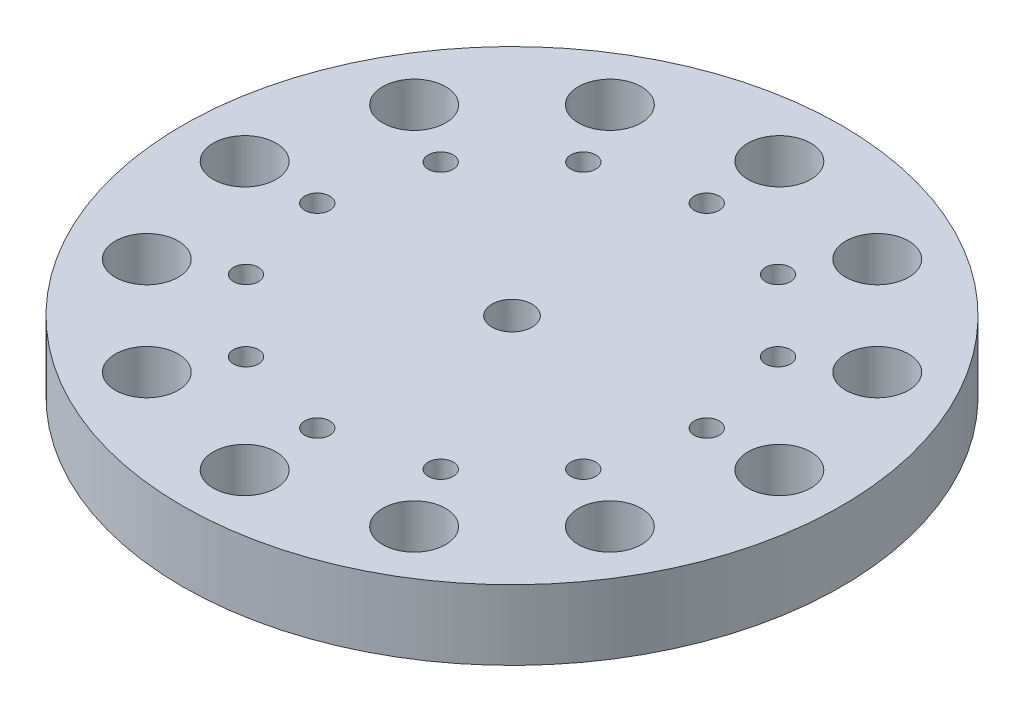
ISO-10303-21;
HEADER;
FILE_DESCRIPTION(('STEP AP214'),'2;1');
FILE_NAME('part.step','',(''),(''),'','','');
FILE_SCHEMA(('AUTOMOTIVE_DESIGN { 1 0 10303 214 1 1 1 1 }'));
ENDSEC;
DATA;
#1=APPLICATION_CONTEXT('core data for automotive mechanical design processes');
#2=APPLICATION_PROTOCOL_DEFINITION('international standard','automotive_design',2000,#1);
#3=PRODUCT_CONTEXT('',#1,'mechanical');
#4=PRODUCT('Part','Part','',(#3));
#5=PRODUCT_RELATED_PRODUCT_CATEGORY('part','',(#4));
#6=PRODUCT_DEFINITION_FORMATION('','',#4);
#7=PRODUCT_DEFINITION_CONTEXT('part definition',#1,'design');
#8=PRODUCT_DEFINITION('design','',#6,#7);
#9=PRODUCT_DEFINITION_SHAPE('','',#8);
#10=(LENGTH_UNIT() NAMED_UNIT(*) SI_UNIT(.MILLI.,.METRE.));
#11=(NAMED_UNIT(*) PLANE_ANGLE_UNIT() SI_UNIT($,.RADIAN.));
#12=(NAMED_UNIT(*) SI_UNIT($,.STERADIAN.) SOLID_ANGLE_UNIT());
#13=UNCERTAINTY_MEASURE_WITH_UNIT(LENGTH_MEASURE(1.E-05),#10,'distance_accuracy_value','');
#14=(GEOMETRIC_REPRESENTATION_CONTEXT(3) GLOBAL_UNCERTAINTY_ASSIGNED_CONTEXT((#13)) GLOBAL_UNIT_ASSIGNED_CONTEXT((#10,
#11,#12)) REPRESENTATION_CONTEXT('',''));
#15=CARTESIAN_POINT('',(0.,0.,0.));
#16=DIRECTION('',(0.,0.,1.));
#17=DIRECTION('',(1.,0.,0.));
#18=AXIS2_PLACEMENT_3D('',#15,#16,#17);
#19=CARTESIAN_POINT('',(0.,0.,104.775));
#20=DIRECTION('',(0.,-1.,0.));
#21=DIRECTION('',(0.,0.,-1.));
#22=AXIS2_PLACEMENT_3D('',#19,#20,#21);
#23=PLANE('',#22);
#24=CARTESIAN_POINT('',(0.,-1.17267306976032E-12,-84.9999951));
#25=DIRECTION('',(0.,1.,0.));
#26=DIRECTION('',(0.,0.,1.));
#27=AXIS2_PLACEMENT_3D('',#24,#25,#26);
#28=CIRCLE('',#27,6.5);
#29=CARTESIAN_POINT('',(0.,-1.17267306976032E-12,-78.4999951));
#30=VERTEX_POINT('',#29);
#31=EDGE_CURVE('E188',#30,#30,#28,.T.);
#32=ORIENTED_EDGE('',*,*,#31,.T.);
#33=EDGE_LOOP('',(#32));
#34=FACE_BOUND('',#33,.T.);
#35=CARTESIAN_POINT('',(42.4999975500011,-1.17267306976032E-12,-73.6121550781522));
#36=DIRECTION('',(0.,1.,0.));
#37=DIRECTION('',(0.,0.,1.));
#38=AXIS2_PLACEMENT_3D('',#35,#36,#37);
#39=CIRCLE('',#38,6.5);
#40=CARTESIAN_POINT('',(42.4999975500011,-1.17267306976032E-12,-67.1121550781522));
#41=VERTEX_POINT('',#40);
#42=EDGE_CURVE('E176',#41,#41,#39,.T.);
#43=ORIENTED_EDGE('',*,*,#42,.T.);
#44=EDGE_LOOP('',(#43));
#45=FACE_BOUND('',#44,.T.);
#46=CARTESIAN_POINT('',(73.6121550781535,-1.17267306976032E-12,-42.4999975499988));
#47=DIRECTION('',(0.,1.,0.));
#48=DIRECTION('',(0.,0.,1.));
#49=AXIS2_PLACEMENT_3D('',#46,#47,#48);
#50=CIRCLE('',#49,6.49999999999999);
#51=CARTESIAN_POINT('',(73.6121550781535,-1.17267306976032E-12,-35.9999975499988));
#52=VERTEX_POINT('',#51);
#53=EDGE_CURVE('E164',#52,#52,#50,.T.);
#54=ORIENTED_EDGE('',*,*,#53,.T.);
#55=EDGE_LOOP('',(#54));
#56=FACE_BOUND('',#55,.T.);
#57=CARTESIAN_POINT('',(84.9999951,-1.17267306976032E-12,1.48145384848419E-12));
#58=DIRECTION('',(0.,1.,0.));
#59=DIRECTION('',(0.,0.,1.));
#60=AXIS2_PLACEMENT_3D('',#57,#58,#59);
#61=CIRCLE('',#60,6.49999999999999);
#62=CARTESIAN_POINT('',(84.9999951,-1.17267306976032E-12,6.50000000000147));
#63=VERTEX_POINT('',#62);
#64=EDGE_CURVE('E152',#63,#63,#61,.T.);
#65=ORIENTED_EDGE('',*,*,#64,.T.);
#66=EDGE_LOOP('',(#65));
#67=FACE_BOUND('',#66,.T.);
#68=CARTESIAN_POINT('',(73.612155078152,-1.17267306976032E-12,42.4999975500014));
#69=DIRECTION('',(0.,1.,0.));
#70=DIRECTION('',(0.,0.,1.));
#71=AXIS2_PLACEMENT_3D('',#68,#69,#70);
#72=CIRCLE('',#71,6.49999999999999);
#73=CARTESIAN_POINT('',(73.612155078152,-1.17267306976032E-12,48.9999975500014));
#74=VERTEX_POINT('',#73);
#75=EDGE_CURVE('E140',#74,#74,#72,.T.);
#76=ORIENTED_EDGE('',*,*,#75,.T.);
#77=EDGE_LOOP('',(#76));
#78=FACE_BOUND('',#77,.T.);
#79=CARTESIAN_POINT('',(42.4999975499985,-1.17267306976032E-12,73.6121550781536));
#80=DIRECTION('',(0.,1.,0.));
#81=DIRECTION('',(0.,0.,1.));
#82=AXIS2_PLACEMENT_3D('',#79,#80,#81);
#83=CIRCLE('',#82,6.5);
#84=CARTESIAN_POINT('',(42.4999975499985,-1.17267306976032E-12,80.1121550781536));
#85=VERTEX_POINT('',#84);
#86=EDGE_CURVE('E128',#85,#85,#83,.T.);
#87=ORIENTED_EDGE('',*,*,#86,.T.);
#88=EDGE_LOOP('',(#87));
#89=FACE_BOUND('',#88,.T.);
#90=CARTESIAN_POINT('',(-6.17561557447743E-13,-1.17267306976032E-12,84.9999951));
#91=DIRECTION('',(0.,1.,0.));
#92=DIRECTION('',(0.,0.,1.));
#93=AXIS2_PLACEMENT_3D('',#90,#91,#92);
#94=CIRCLE('',#93,6.5);
#95=CARTESIAN_POINT('',(-6.17561557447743E-13,-1.17267306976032E-12,91.4999951));
#96=VERTEX_POINT('',#95);
#97=EDGE_CURVE('E116',#96,#96,#94,.T.);
#98=ORIENTED_EDGE('',*,*,#97,.T.);
#99=EDGE_LOOP('',(#98));
#100=FACE_BOUND('',#99,.T.);
#101=CARTESIAN_POINT('',(-42.4999975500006,-1.17267306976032E-12,73.6121550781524));
#102=DIRECTION('',(0.,1.,0.));
#103=DIRECTION('',(0.,0.,1.));
#104=AXIS2_PLACEMENT_3D('',#101,#102,#103);
#105=CIRCLE('',#104,6.49999999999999);
#106=CARTESIAN_POINT('',(-42.4999975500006,-1.17267306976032E-12,80.1121550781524));
#107=VERTEX_POINT('',#106);
#108=EDGE_CURVE('E104',#107,#107,#105,.T.);
#109=ORIENTED_EDGE('',*,*,#108,.T.);
#110=EDGE_LOOP('',(#109));
#111=FACE_BOUND('',#110,.T.);
#112=CARTESIAN_POINT('',(-73.6121550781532,-1.17267306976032E-12,42.4999975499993));
#113=DIRECTION('',(0.,1.,0.));
#114=DIRECTION('',(0.,0.,1.));
#115=AXIS2_PLACEMENT_3D('',#112,#113,#114);
#116=CIRCLE('',#115,6.49999999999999);
#117=CARTESIAN_POINT('',(-73.6121550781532,-1.17267306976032E-12,48.9999975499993));
#118=VERTEX_POINT('',#117);
#119=EDGE_CURVE('E92',#118,#118,#116,.T.);
#120=ORIENTED_EDGE('',*,*,#119,.T.);
#121=EDGE_LOOP('',(#120));
#122=FACE_BOUND('',#121,.T.);
#123=CARTESIAN_POINT('',(-84.9999951,-1.17267306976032E-12,-8.95117313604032E-13));
#124=DIRECTION('',(0.,1.,0.));
#125=DIRECTION('',(0.,0.,1.));
#126=AXIS2_PLACEMENT_3D('',#123,#124,#125);
#127=CIRCLE('',#126,6.49999999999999);
#128=CARTESIAN_POINT('',(-84.9999951,-1.17267306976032E-12,6.4999999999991));
#129=VERTEX_POINT('',#128);
#130=EDGE_CURVE('E80',#129,#129,#127,.T.);
#131=ORIENTED_EDGE('',*,*,#130,.T.);
#132=EDGE_LOOP('',(#131));
#133=FACE_BOUND('',#132,.T.);
#134=CARTESIAN_POINT('',(-73.6121550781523,-1.17267306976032E-12,-42.4999975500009));
#135=DIRECTION('',(0.,1.,0.));
#136=DIRECTION('',(0.,0.,1.));
#137=AXIS2_PLACEMENT_3D('',#134,#135,#136);
#138=CIRCLE('',#137,6.49999999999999);
#139=CARTESIAN_POINT('',(-73.6121550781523,-1.17267306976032E-12,-35.9999975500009));
#140=VERTEX_POINT('',#139);
#141=EDGE_CURVE('E68',#140,#140,#138,.T.);
#142=ORIENTED_EDGE('',*,*,#141,.T.);
#143=EDGE_LOOP('',(#142));
#144=FACE_BOUND('',#143,.T.);
#145=CARTESIAN_POINT('',(-42.499997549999,-1.17267306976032E-12,-73.6121550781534));
#146=DIRECTION('',(0.,1.,0.));
#147=DIRECTION('',(0.,0.,1.));
#148=AXIS2_PLACEMENT_3D('',#145,#146,#147);
#149=CIRCLE('',#148,6.49999999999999);
#150=CARTESIAN_POINT('',(-42.499997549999,-1.17267306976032E-12,-67.1121550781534));
#151=VERTEX_POINT('',#150);
#152=EDGE_CURVE('E56',#151,#151,#149,.T.);
#153=ORIENTED_EDGE('',*,*,#152,.T.);
#154=EDGE_LOOP('',(#153));
#155=FACE_BOUND('',#154,.T.);
#156=CARTESIAN_POINT('',(0.,0.,0.));
#157=DIRECTION('',(0.,1.,0.));
#158=DIRECTION('',(0.,0.,1.));
#159=AXIS2_PLACEMENT_3D('',#156,#157,#158);
#160=CIRCLE('',#159,104.775);
#161=CARTESIAN_POINT('',(0.,0.,104.775));
#162=VERTEX_POINT('',#161);
#163=EDGE_CURVE('E51',#162,#162,#160,.T.);
#164=ORIENTED_EDGE('',*,*,#163,.F.);
#165=EDGE_LOOP('',(#164));
#166=FACE_BOUND('',#165,.T.);
#167=CARTESIAN_POINT('',(0.,0.,0.));
#168=DIRECTION('',(0.,-1.,0.));
#169=DIRECTION('',(0.,0.,-1.));
#170=AXIS2_PLACEMENT_3D('',#167,#168,#169);
#171=CIRCLE('',#170,76.4921);
#172=CARTESIAN_POINT('',(0.,0.,76.4921));
#173=VERTEX_POINT('',#172);
#174=EDGE_CURVE('E236',#173,#173,#171,.T.);
#175=ORIENTED_EDGE('',*,*,#174,.F.);
#176=EDGE_LOOP('',(#175));
#177=FACE_BOUND('',#176,.T.);
#178=ADVANCED_FACE('F36',(#34,#45,#56,#67,#78,#89,#100,#111,#122,#133,#144,#155,#166,#177),#23,.T.);
#179=CARTESIAN_POINT('',(0.,22.2249999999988,104.775000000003));
#180=DIRECTION('',(0.,-1.,0.));
#181=DIRECTION('',(0.,0.,-1.));
#182=AXIS2_PLACEMENT_3D('',#179,#180,#181);
#183=PLANE('',#182);
#184=CARTESIAN_POINT('',(0.,22.2249999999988,0.));
#185=DIRECTION('',(0.,-1.,0.));
#186=DIRECTION('',(0.,0.,-1.));
#187=AXIS2_PLACEMENT_3D('',#184,#185,#186);
#188=CIRCLE('',#187,6.36270000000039);
#189=CARTESIAN_POINT('',(0.,22.2249999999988,-6.36270000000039));
#190=VERTEX_POINT('',#189);
#191=EDGE_CURVE('E275',#190,#190,#188,.T.);
#192=ORIENTED_EDGE('',*,*,#191,.T.);
#193=EDGE_LOOP('',(#192));
#194=FACE_BOUND('',#193,.T.);
#195=CARTESIAN_POINT('',(-53.6177978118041,22.2249999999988,-30.95625));
#196=DIRECTION('',(0.,1.,0.));
#197=DIRECTION('',(0.,0.,1.));
#198=AXIS2_PLACEMENT_3D('',#195,#196,#197);
#199=CIRCLE('',#198,3.96875);
#200=CARTESIAN_POINT('',(-53.6177978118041,22.2249999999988,-26.9875));
#201=VERTEX_POINT('',#200);
#202=EDGE_CURVE('E233',#201,#201,#199,.T.);
#203=ORIENTED_EDGE('',*,*,#202,.F.);
#204=EDGE_LOOP('',(#203));
#205=FACE_BOUND('',#204,.T.);
#206=CARTESIAN_POINT('',(-61.9125,22.2249999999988,0.));
#207=DIRECTION('',(0.,1.,0.));
#208=DIRECTION('',(0.,0.,1.));
#209=AXIS2_PLACEMENT_3D('',#206,#207,#208);
#210=CIRCLE('',#209,3.96875);
#211=CARTESIAN_POINT('',(-61.9125,22.2249999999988,3.96875000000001));
#212=VERTEX_POINT('',#211);
#213=EDGE_CURVE('E230',#212,#212,#210,.T.);
#214=ORIENTED_EDGE('',*,*,#213,.F.);
#215=EDGE_LOOP('',(#214));
#216=FACE_BOUND('',#215,.T.);
#217=CARTESIAN_POINT('',(-53.6177978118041,22.2249999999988,30.95625));
#218=DIRECTION('',(0.,1.,0.));
#219=DIRECTION('',(0.,0.,1.));
#220=AXIS2_PLACEMENT_3D('',#217,#218,#219);
#221=CIRCLE('',#220,3.96875);
#222=CARTESIAN_POINT('',(-53.6177978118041,22.2249999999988,34.925));
#223=VERTEX_POINT('',#222);
#224=EDGE_CURVE('E227',#223,#223,#221,.T.);
#225=ORIENTED_EDGE('',*,*,#224,.F.);
#226=EDGE_LOOP('',(#225));
#227=FACE_BOUND('',#226,.T.);
#228=CARTESIAN_POINT('',(-30.95625,22.2249999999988,53.6177978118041));
#229=DIRECTION('',(0.,1.,0.));
#230=DIRECTION('',(0.,0.,1.));
#231=AXIS2_PLACEMENT_3D('',#228,#229,#230);
#232=CIRCLE('',#231,3.96875);
#233=CARTESIAN_POINT('',(-30.95625,22.2249999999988,57.5865478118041));
#234=VERTEX_POINT('',#233);
#235=EDGE_CURVE('E224',#234,#234,#232,.T.);
#236=ORIENTED_EDGE('',*,*,#235,.F.);
#237=EDGE_LOOP('',(#236));
#238=FACE_BOUND('',#237,.T.);
#239=CARTESIAN_POINT('',(0.,22.2249999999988,61.9125));
#240=DIRECTION('',(0.,1.,0.));
#241=DIRECTION('',(0.,0.,1.));
#242=AXIS2_PLACEMENT_3D('',#239,#240,#241);
#243=CIRCLE('',#242,3.96875);
#244=CARTESIAN_POINT('',(0.,22.2249999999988,65.88125));
#245=VERTEX_POINT('',#244);
#246=EDGE_CURVE('E221',#245,#245,#243,.T.);
#247=ORIENTED_EDGE('',*,*,#246,.F.);
#248=EDGE_LOOP('',(#247));
#249=FACE_BOUND('',#248,.T.);
#250=CARTESIAN_POINT('',(30.95625,22.2249999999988,53.6177978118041));
#251=DIRECTION('',(0.,1.,0.));
#252=DIRECTION('',(0.,0.,1.));
#253=AXIS2_PLACEMENT_3D('',#250,#251,#252);
#254=CIRCLE('',#253,3.96875);
#255=CARTESIAN_POINT('',(30.95625,22.2249999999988,57.5865478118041));
#256=VERTEX_POINT('',#255);
#257=EDGE_CURVE('E218',#256,#256,#254,.T.);
#258=ORIENTED_EDGE('',*,*,#257,.F.);
#259=EDGE_LOOP('',(#258));
#260=FACE_BOUND('',#259,.T.);
#261=CARTESIAN_POINT('',(53.6177978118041,22.2249999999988,30.95625));
#262=DIRECTION('',(0.,1.,0.));
#263=DIRECTION('',(0.,0.,1.));
#264=AXIS2_PLACEMENT_3D('',#261,#262,#263);
#265=CIRCLE('',#264,3.96875);
#266=CARTESIAN_POINT('',(53.6177978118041,22.2249999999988,34.925));
#267=VERTEX_POINT('',#266);
#268=EDGE_CURVE('E215',#267,#267,#265,.T.);
#269=ORIENTED_EDGE('',*,*,#268,.F.);
#270=EDGE_LOOP('',(#269));
#271=FACE_BOUND('',#270,.T.);
#272=CARTESIAN_POINT('',(61.9125,22.2249999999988,0.));
#273=DIRECTION('',(0.,1.,0.));
#274=DIRECTION('',(0.,0.,1.));
#275=AXIS2_PLACEMENT_3D('',#272,#273,#274);
#276=CIRCLE('',#275,3.96874999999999);
#277=CARTESIAN_POINT('',(61.9125,22.2249999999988,3.96874999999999));
#278=VERTEX_POINT('',#277);
#279=EDGE_CURVE('E212',#278,#278,#276,.T.);
#280=ORIENTED_EDGE('',*,*,#279,.F.);
#281=EDGE_LOOP('',(#280));
#282=FACE_BOUND('',#281,.T.);
#283=CARTESIAN_POINT('',(53.6177978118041,22.2249999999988,-30.95625));
#284=DIRECTION('',(0.,1.,0.));
#285=DIRECTION('',(0.,0.,1.));
#286=AXIS2_PLACEMENT_3D('',#283,#284,#285);
#287=CIRCLE('',#286,3.96875);
#288=CARTESIAN_POINT('',(53.6177978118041,22.2249999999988,-26.9875));
#289=VERTEX_POINT('',#288);
#290=EDGE_CURVE('E209',#289,#289,#287,.T.);
#291=ORIENTED_EDGE('',*,*,#290,.F.);
#292=EDGE_LOOP('',(#291));
#293=FACE_BOUND('',#292,.T.);
#294=CARTESIAN_POINT('',(30.95625,22.2249999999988,-53.6177978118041));
#295=DIRECTION('',(0.,1.,0.));
#296=DIRECTION('',(0.,0.,1.));
#297=AXIS2_PLACEMENT_3D('',#294,#295,#296);
#298=CIRCLE('',#297,3.96875);
#299=CARTESIAN_POINT('',(30.95625,22.2249999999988,-49.6490478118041));
#300=VERTEX_POINT('',#299);
#301=EDGE_CURVE('E206',#300,#300,#298,.T.);
#302=ORIENTED_EDGE('',*,*,#301,.F.);
#303=EDGE_LOOP('',(#302));
#304=FACE_BOUND('',#303,.T.);
#305=CARTESIAN_POINT('',(0.,22.2249999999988,-61.9125));
#306=DIRECTION('',(0.,1.,0.));
#307=DIRECTION('',(0.,0.,1.));
#308=AXIS2_PLACEMENT_3D('',#305,#306,#307);
#309=CIRCLE('',#308,3.96875);
#310=CARTESIAN_POINT('',(0.,22.2249999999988,-57.94375));
#311=VERTEX_POINT('',#310);
#312=EDGE_CURVE('E203',#311,#311,#309,.T.);
#313=ORIENTED_EDGE('',*,*,#312,.F.);
#314=EDGE_LOOP('',(#313));
#315=FACE_BOUND('',#314,.T.);
#316=CARTESIAN_POINT('',(-30.95625,22.2249999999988,-53.6177978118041));
#317=DIRECTION('',(0.,1.,0.));
#318=DIRECTION('',(0.,0.,1.));
#319=AXIS2_PLACEMENT_3D('',#316,#317,#318);
#320=CIRCLE('',#319,3.96875);
#321=CARTESIAN_POINT('',(-30.95625,22.2249999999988,-49.6490478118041));
#322=VERTEX_POINT('',#321);
#323=EDGE_CURVE('E200',#322,#322,#320,.T.);
#324=ORIENTED_EDGE('',*,*,#323,.F.);
#325=EDGE_LOOP('',(#324));
#326=FACE_BOUND('',#325,.T.);
#327=CARTESIAN_POINT('',(0.,22.2249999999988,-84.9999951));
#328=DIRECTION('',(0.,1.,0.));
#329=DIRECTION('',(0.,0.,1.));
#330=AXIS2_PLACEMENT_3D('',#327,#328,#329);
#331=CIRCLE('',#330,10.);
#332=CARTESIAN_POINT('',(0.,22.2249999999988,-74.9999951));
#333=VERTEX_POINT('',#332);
#334=EDGE_CURVE('E197',#333,#333,#331,.T.);
#335=ORIENTED_EDGE('',*,*,#334,.F.);
#336=EDGE_LOOP('',(#335));
#337=FACE_BOUND('',#336,.T.);
#338=CARTESIAN_POINT('',(42.4999975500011,22.2249999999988,-73.6121550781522));
#339=DIRECTION('',(0.,1.,0.));
#340=DIRECTION('',(0.,0.,1.));
#341=AXIS2_PLACEMENT_3D('',#338,#339,#340);
#342=CIRCLE('',#341,10.);
#343=CARTESIAN_POINT('',(42.4999975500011,22.2249999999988,-63.6121550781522));
#344=VERTEX_POINT('',#343);
#345=EDGE_CURVE('E185',#344,#344,#342,.T.);
#346=ORIENTED_EDGE('',*,*,#345,.F.);
#347=EDGE_LOOP('',(#346));
#348=FACE_BOUND('',#347,.T.);
#349=CARTESIAN_POINT('',(73.6121550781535,22.2249999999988,-42.4999975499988));
#350=DIRECTION('',(0.,1.,0.));
#351=DIRECTION('',(0.,0.,1.));
#352=AXIS2_PLACEMENT_3D('',#349,#350,#351);
#353=CIRCLE('',#352,9.99999999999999);
#354=CARTESIAN_POINT('',(73.6121550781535,22.2249999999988,-32.4999975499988));
#355=VERTEX_POINT('',#354);
#356=EDGE_CURVE('E173',#355,#355,#353,.T.);
#357=ORIENTED_EDGE('',*,*,#356,.F.);
#358=EDGE_LOOP('',(#357));
#359=FACE_BOUND('',#358,.T.);
#360=CARTESIAN_POINT('',(84.9999951,22.2249999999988,1.48145384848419E-12));
#361=DIRECTION('',(0.,1.,0.));
#362=DIRECTION('',(0.,0.,1.));
#363=AXIS2_PLACEMENT_3D('',#360,#361,#362);
#364=CIRCLE('',#363,9.99999999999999);
#365=CARTESIAN_POINT('',(84.9999951,22.2249999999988,10.0000000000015));
#366=VERTEX_POINT('',#365);
#367=EDGE_CURVE('E161',#366,#366,#364,.T.);
#368=ORIENTED_EDGE('',*,*,#367,.F.);
#369=EDGE_LOOP('',(#368));
#370=FACE_BOUND('',#369,.T.);
#371=CARTESIAN_POINT('',(73.612155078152,22.2249999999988,42.4999975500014));
#372=DIRECTION('',(0.,1.,0.));
#373=DIRECTION('',(0.,0.,1.));
#374=AXIS2_PLACEMENT_3D('',#371,#372,#373);
#375=CIRCLE('',#374,9.99999999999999);
#376=CARTESIAN_POINT('',(73.612155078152,22.2249999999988,52.4999975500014));
#377=VERTEX_POINT('',#376);
#378=EDGE_CURVE('E149',#377,#377,#375,.T.);
#379=ORIENTED_EDGE('',*,*,#378,.F.);
#380=EDGE_LOOP('',(#379));
#381=FACE_BOUND('',#380,.T.);
#382=CARTESIAN_POINT('',(42.4999975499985,22.2249999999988,73.6121550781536));
#383=DIRECTION('',(0.,1.,0.));
#384=DIRECTION('',(0.,0.,1.));
#385=AXIS2_PLACEMENT_3D('',#382,#383,#384);
#386=CIRCLE('',#385,10.);
#387=CARTESIAN_POINT('',(42.4999975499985,22.2249999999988,83.6121550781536));
#388=VERTEX_POINT('',#387);
#389=EDGE_CURVE('E137',#388,#388,#386,.T.);
#390=ORIENTED_EDGE('',*,*,#389,.F.);
#391=EDGE_LOOP('',(#390));
#392=FACE_BOUND('',#391,.T.);
#393=CARTESIAN_POINT('',(-6.17561557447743E-13,22.2249999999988,84.9999951));
#394=DIRECTION('',(0.,1.,0.));
#395=DIRECTION('',(0.,0.,1.));
#396=AXIS2_PLACEMENT_3D('',#393,#394,#395);
#397=CIRCLE('',#396,10.);
#398=CARTESIAN_POINT('',(-6.17561557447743E-13,22.2249999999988,94.9999951));
#399=VERTEX_POINT('',#398);
#400=EDGE_CURVE('E125',#399,#399,#397,.T.);
#401=ORIENTED_EDGE('',*,*,#400,.F.);
#402=EDGE_LOOP('',(#401));
#403=FACE_BOUND('',#402,.T.);
#404=CARTESIAN_POINT('',(-73.6121550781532,22.2249999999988,42.4999975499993));
#405=DIRECTION('',(0.,1.,0.));
#406=DIRECTION('',(0.,0.,1.));
#407=AXIS2_PLACEMENT_3D('',#404,#405,#406);
#408=CIRCLE('',#407,9.99999999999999);
#409=CARTESIAN_POINT('',(-73.6121550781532,22.2249999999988,52.4999975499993));
#410=VERTEX_POINT('',#409);
#411=EDGE_CURVE('E101',#410,#410,#408,.T.);
#412=ORIENTED_EDGE('',*,*,#411,.F.);
#413=EDGE_LOOP('',(#412));
#414=FACE_BOUND('',#413,.T.);
#415=CARTESIAN_POINT('',(-84.9999951,22.2249999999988,-8.95117313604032E-13));
#416=DIRECTION('',(0.,1.,0.));
#417=DIRECTION('',(0.,0.,1.));
#418=AXIS2_PLACEMENT_3D('',#415,#416,#417);
#419=CIRCLE('',#418,9.99999999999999);
#420=CARTESIAN_POINT('',(-84.9999951,22.2249999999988,9.9999999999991));
#421=VERTEX_POINT('',#420);
#422=EDGE_CURVE('E89',#421,#421,#419,.T.);
#423=ORIENTED_EDGE('',*,*,#422,.F.);
#424=EDGE_LOOP('',(#423));
#425=FACE_BOUND('',#424,.T.);
#426=CARTESIAN_POINT('',(-73.6121550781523,22.2249999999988,-42.4999975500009));
#427=DIRECTION('',(0.,1.,0.));
#428=DIRECTION('',(0.,0.,1.));
#429=AXIS2_PLACEMENT_3D('',#426,#427,#428);
#430=CIRCLE('',#429,9.99999999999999);
#431=CARTESIAN_POINT('',(-73.6121550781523,22.2249999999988,-32.4999975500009));
#432=VERTEX_POINT('',#431);
#433=EDGE_CURVE('E77',#432,#432,#430,.T.);
#434=ORIENTED_EDGE('',*,*,#433,.F.);
#435=EDGE_LOOP('',(#434));
#436=FACE_BOUND('',#435,.T.);
#437=CARTESIAN_POINT('',(-42.499997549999,22.2249999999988,-73.6121550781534));
#438=DIRECTION('',(0.,1.,0.));
#439=DIRECTION('',(0.,0.,1.));
#440=AXIS2_PLACEMENT_3D('',#437,#438,#439);
#441=CIRCLE('',#440,9.99999999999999);
#442=CARTESIAN_POINT('',(-42.499997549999,22.2249999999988,-63.6121550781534));
#443=VERTEX_POINT('',#442);
#444=EDGE_CURVE('E65',#443,#443,#441,.T.);
#445=ORIENTED_EDGE('',*,*,#444,.F.);
#446=EDGE_LOOP('',(#445));
#447=FACE_BOUND('',#446,.T.);
#448=CARTESIAN_POINT('',(0.,22.2249999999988,0.));
#449=DIRECTION('',(0.,1.,0.));
#450=DIRECTION('',(0.,0.,1.));
#451=AXIS2_PLACEMENT_3D('',#448,#449,#450);
#452=CIRCLE('',#451,104.775000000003);
#453=CARTESIAN_POINT('',(0.,22.2249999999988,104.775000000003));
#454=VERTEX_POINT('',#453);
#455=EDGE_CURVE('E47',#454,#454,#452,.T.);
#456=ORIENTED_EDGE('',*,*,#455,.T.);
#457=EDGE_LOOP('',(#456));
#458=FACE_BOUND('',#457,.T.);
#459=CARTESIAN_POINT('',(-42.4999975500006,22.2249999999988,73.6121550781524));
#460=DIRECTION('',(0.,1.,0.));
#461=DIRECTION('',(0.,0.,1.));
#462=AXIS2_PLACEMENT_3D('',#459,#460,#461);
#463=CIRCLE('',#462,9.99999999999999);
#464=CARTESIAN_POINT('',(-42.4999975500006,22.2249999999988,83.6121550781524));
#465=VERTEX_POINT('',#464);
#466=EDGE_CURVE('E113',#465,#465,#463,.T.);
#467=ORIENTED_EDGE('',*,*,#466,.F.);
#468=EDGE_LOOP('',(#467));
#469=FACE_BOUND('',#468,.T.);
#470=ADVANCED_FACE('F290',(#194,#205,#216,#227,#238,#249,#260,#271,#282,#293,#304,#315,#326,
#337,#348,#359,#370,#381,#392,#403,#414,#425,#436,#447,#458,#469),#183,.F.);
#471=CARTESIAN_POINT('',(0.,0.,0.));
#472=DIRECTION('',(0.,1.,0.));
#473=DIRECTION('',(0.,0.,1.));
#474=AXIS2_PLACEMENT_3D('',#471,#472,#473);
#475=CYLINDRICAL_SURFACE('',#474,104.775000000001);
#476=ORIENTED_EDGE('',*,*,#455,.F.);
#477=EDGE_LOOP('',(#476));
#478=FACE_BOUND('',#477,.T.);
#479=ORIENTED_EDGE('',*,*,#163,.T.);
#480=EDGE_LOOP('',(#479));
#481=FACE_BOUND('',#480,.T.);
#482=ADVANCED_FACE('F293',(#478,#481),#475,.T.);
#483=CARTESIAN_POINT('',(-42.499997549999,22.2249999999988,-73.6121550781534));
#484=DIRECTION('',(0.,1.,0.));
#485=DIRECTION('',(0.,0.,1.));
#486=AXIS2_PLACEMENT_3D('',#483,#484,#485);
#487=CYLINDRICAL_SURFACE('',#486,6.5);
#488=ORIENTED_EDGE('',*,*,#152,.F.);
#489=EDGE_LOOP('',(#488));
#490=FACE_BOUND('',#489,.T.);
#491=CARTESIAN_POINT('',(-42.499997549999,7.22500599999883,-73.6121550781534));
#492=DIRECTION('',(0.,1.,0.));
#493=DIRECTION('',(0.,0.,1.));
#494=AXIS2_PLACEMENT_3D('',#491,#492,#493);
#495=CIRCLE('',#494,6.5);
#496=CARTESIAN_POINT('',(-42.499997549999,7.22500599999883,-67.1121550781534));
#497=VERTEX_POINT('',#496);
#498=EDGE_CURVE('E59',#497,#497,#495,.T.);
#499=ORIENTED_EDGE('',*,*,#498,.T.);
#500=EDGE_LOOP('',(#499));
#501=FACE_BOUND('',#500,.T.);
#502=ADVANCED_FACE('F369',(#490,#501),#487,.F.);
#503=CARTESIAN_POINT('',(-35.999997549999,7.22500599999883,-73.6121550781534));
#504=DIRECTION('',(0.,-1.,0.));
#505=DIRECTION('',(0.,0.,-1.));
#506=AXIS2_PLACEMENT_3D('',#503,#504,#505);
#507=PLANE('',#506);
#508=ORIENTED_EDGE('',*,*,#498,.F.);
#509=EDGE_LOOP('',(#508));
#510=FACE_BOUND('',#509,.T.);
#511=CARTESIAN_POINT('',(-42.499997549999,7.22500599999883,-73.6121550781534));
#512=DIRECTION('',(0.,1.,0.));
#513=DIRECTION('',(0.,0.,1.));
#514=AXIS2_PLACEMENT_3D('',#511,#512,#513);
#515=CIRCLE('',#514,9.99999999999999);
#516=CARTESIAN_POINT('',(-42.499997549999,7.22500599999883,-63.6121550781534));
#517=VERTEX_POINT('',#516);
#518=EDGE_CURVE('E62',#517,#517,#515,.T.);
#519=ORIENTED_EDGE('',*,*,#518,.T.);
#520=EDGE_LOOP('',(#519));
#521=FACE_BOUND('',#520,.T.);
#522=ADVANCED_FACE('F376',(#510,#521),#507,.F.);
#523=CARTESIAN_POINT('',(-42.499997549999,22.2249999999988,-73.6121550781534));
#524=DIRECTION('',(0.,1.,0.));
#525=DIRECTION('',(0.,0.,1.));
#526=AXIS2_PLACEMENT_3D('',#523,#524,#525);
#527=CYLINDRICAL_SURFACE('',#526,9.99999999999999);
#528=ORIENTED_EDGE('',*,*,#518,.F.);
#529=EDGE_LOOP('',(#528));
#530=FACE_BOUND('',#529,.T.);
#531=ORIENTED_EDGE('',*,*,#444,.T.);
#532=EDGE_LOOP('',(#531));
#533=FACE_BOUND('',#532,.T.);
#534=ADVANCED_FACE('F909',(#530,#533),#527,.F.);
#535=CARTESIAN_POINT('',(-73.6121550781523,22.2249999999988,-42.4999975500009));
#536=DIRECTION('',(0.,1.,0.));
#537=DIRECTION('',(0.,0.,1.));
#538=AXIS2_PLACEMENT_3D('',#535,#536,#537);
#539=CYLINDRICAL_SURFACE('',#538,6.49999999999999);
#540=ORIENTED_EDGE('',*,*,#141,.F.);
#541=EDGE_LOOP('',(#540));
#542=FACE_BOUND('',#541,.T.);
#543=CARTESIAN_POINT('',(-73.6121550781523,7.22500599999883,-42.4999975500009));
#544=DIRECTION('',(0.,1.,0.));
#545=DIRECTION('',(0.,0.,1.));
#546=AXIS2_PLACEMENT_3D('',#543,#544,#545);
#547=CIRCLE('',#546,6.49999999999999);
#548=CARTESIAN_POINT('',(-73.6121550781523,7.22500599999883,-35.9999975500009));
#549=VERTEX_POINT('',#548);
#550=EDGE_CURVE('E71',#549,#549,#547,.T.);
#551=ORIENTED_EDGE('',*,*,#550,.T.);
#552=EDGE_LOOP('',(#551));
#553=FACE_BOUND('',#552,.T.);
#554=ADVANCED_FACE('F900',(#542,#553),#539,.F.);
#555=CARTESIAN_POINT('',(-67.1121550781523,7.22500599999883,-42.4999975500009));
#556=DIRECTION('',(0.,-1.,0.));
#557=DIRECTION('',(0.,0.,-1.));
#558=AXIS2_PLACEMENT_3D('',#555,#556,#557);
#559=PLANE('',#558);
#560=ORIENTED_EDGE('',*,*,#550,.F.);
#561=EDGE_LOOP('',(#560));
#562=FACE_BOUND('',#561,.T.);
#563=CARTESIAN_POINT('',(-73.6121550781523,7.22500599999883,-42.4999975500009));
#564=DIRECTION('',(0.,1.,0.));
#565=DIRECTION('',(0.,0.,1.));
#566=AXIS2_PLACEMENT_3D('',#563,#564,#565);
#567=CIRCLE('',#566,9.99999999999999);
#568=CARTESIAN_POINT('',(-73.6121550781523,7.22500599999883,-32.4999975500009));
#569=VERTEX_POINT('',#568);
#570=EDGE_CURVE('E74',#569,#569,#567,.T.);
#571=ORIENTED_EDGE('',*,*,#570,.T.);
#572=EDGE_LOOP('',(#571));
#573=FACE_BOUND('',#572,.T.);
#574=ADVANCED_FACE('F891',(#562,#573),#559,.F.);
#575=CARTESIAN_POINT('',(-73.6121550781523,22.2249999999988,-42.4999975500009));
#576=DIRECTION('',(0.,1.,0.));
#577=DIRECTION('',(0.,0.,1.));
#578=AXIS2_PLACEMENT_3D('',#575,#576,#577);
#579=CYLINDRICAL_SURFACE('',#578,9.99999999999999);
#580=ORIENTED_EDGE('',*,*,#570,.F.);
#581=EDGE_LOOP('',(#580));
#582=FACE_BOUND('',#581,.T.);
#583=ORIENTED_EDGE('',*,*,#433,.T.);
#584=EDGE_LOOP('',(#583));
#585=FACE_BOUND('',#584,.T.);
#586=ADVANCED_FACE('F882',(#582,#585),#579,.F.);
#587=CARTESIAN_POINT('',(-84.9999951,22.2249999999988,-8.95117313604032E-13));
#588=DIRECTION('',(0.,1.,0.));
#589=DIRECTION('',(0.,0.,1.));
#590=AXIS2_PLACEMENT_3D('',#587,#588,#589);
#591=CYLINDRICAL_SURFACE('',#590,6.49999999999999);
#592=ORIENTED_EDGE('',*,*,#130,.F.);
#593=EDGE_LOOP('',(#592));
#594=FACE_BOUND('',#593,.T.);
#595=CARTESIAN_POINT('',(-84.9999951,7.22500599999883,-8.95117313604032E-13));
#596=DIRECTION('',(0.,1.,0.));
#597=DIRECTION('',(0.,0.,1.));
#598=AXIS2_PLACEMENT_3D('',#595,#596,#597);
#599=CIRCLE('',#598,6.49999999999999);
#600=CARTESIAN_POINT('',(-84.9999951,7.22500599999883,6.4999999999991));
#601=VERTEX_POINT('',#600);
#602=EDGE_CURVE('E83',#601,#601,#599,.T.);
#603=ORIENTED_EDGE('',*,*,#602,.T.);
#604=EDGE_LOOP('',(#603));
#605=FACE_BOUND('',#604,.T.);
#606=ADVANCED_FACE('F873',(#594,#605),#591,.F.);
#607=CARTESIAN_POINT('',(-78.4999951,7.22500599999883,-8.95117313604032E-13));
#608=DIRECTION('',(0.,-1.,0.));
#609=DIRECTION('',(0.,0.,-1.));
#610=AXIS2_PLACEMENT_3D('',#607,#608,#609);
#611=PLANE('',#610);
#612=ORIENTED_EDGE('',*,*,#602,.F.);
#613=EDGE_LOOP('',(#612));
#614=FACE_BOUND('',#613,.T.);
#615=CARTESIAN_POINT('',(-84.9999951,7.22500599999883,-8.95117313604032E-13));
#616=DIRECTION('',(0.,1.,0.));
#617=DIRECTION('',(0.,0.,1.));
#618=AXIS2_PLACEMENT_3D('',#615,#616,#617);
#619=CIRCLE('',#618,9.99999999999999);
#620=CARTESIAN_POINT('',(-84.9999951,7.22500599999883,9.9999999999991));
#621=VERTEX_POINT('',#620);
#622=EDGE_CURVE('E86',#621,#621,#619,.T.);
#623=ORIENTED_EDGE('',*,*,#622,.T.);
#624=EDGE_LOOP('',(#623));
#625=FACE_BOUND('',#624,.T.);
#626=ADVANCED_FACE('F864',(#614,#625),#611,.F.);
#627=CARTESIAN_POINT('',(-84.9999951,22.2249999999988,-8.95117313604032E-13));
#628=DIRECTION('',(0.,1.,0.));
#629=DIRECTION('',(0.,0.,1.));
#630=AXIS2_PLACEMENT_3D('',#627,#628,#629);
#631=CYLINDRICAL_SURFACE('',#630,9.99999999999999);
#632=ORIENTED_EDGE('',*,*,#622,.F.);
#633=EDGE_LOOP('',(#632));
#634=FACE_BOUND('',#633,.T.);
#635=ORIENTED_EDGE('',*,*,#422,.T.);
#636=EDGE_LOOP('',(#635));
#637=FACE_BOUND('',#636,.T.);
#638=ADVANCED_FACE('F855',(#634,#637),#631,.F.);
#639=CARTESIAN_POINT('',(-73.6121550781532,22.2249999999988,42.4999975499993));
#640=DIRECTION('',(0.,1.,0.));
#641=DIRECTION('',(0.,0.,1.));
#642=AXIS2_PLACEMENT_3D('',#639,#640,#641);
#643=CYLINDRICAL_SURFACE('',#642,6.49999999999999);
#644=ORIENTED_EDGE('',*,*,#119,.F.);
#645=EDGE_LOOP('',(#644));
#646=FACE_BOUND('',#645,.T.);
#647=CARTESIAN_POINT('',(-73.6121550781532,7.22500599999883,42.4999975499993));
#648=DIRECTION('',(0.,1.,0.));
#649=DIRECTION('',(0.,0.,1.));
#650=AXIS2_PLACEMENT_3D('',#647,#648,#649);
#651=CIRCLE('',#650,6.49999999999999);
#652=CARTESIAN_POINT('',(-73.6121550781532,7.22500599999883,48.9999975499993));
#653=VERTEX_POINT('',#652);
#654=EDGE_CURVE('E95',#653,#653,#651,.T.);
#655=ORIENTED_EDGE('',*,*,#654,.T.);
#656=EDGE_LOOP('',(#655));
#657=FACE_BOUND('',#656,.T.);
#658=ADVANCED_FACE('F846',(#646,#657),#643,.F.);
#659=CARTESIAN_POINT('',(-67.1121550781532,7.22500599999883,42.4999975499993));
#660=DIRECTION('',(0.,-1.,0.));
#661=DIRECTION('',(0.,0.,-1.));
#662=AXIS2_PLACEMENT_3D('',#659,#660,#661);
#663=PLANE('',#662);
#664=ORIENTED_EDGE('',*,*,#654,.F.);
#665=EDGE_LOOP('',(#664));
#666=FACE_BOUND('',#665,.T.);
#667=CARTESIAN_POINT('',(-73.6121550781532,7.22500599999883,42.4999975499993));
#668=DIRECTION('',(0.,1.,0.));
#669=DIRECTION('',(0.,0.,1.));
#670=AXIS2_PLACEMENT_3D('',#667,#668,#669);
#671=CIRCLE('',#670,9.99999999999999);
#672=CARTESIAN_POINT('',(-73.6121550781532,7.22500599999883,52.4999975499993));
#673=VERTEX_POINT('',#672);
#674=EDGE_CURVE('E98',#673,#673,#671,.T.);
#675=ORIENTED_EDGE('',*,*,#674,.T.);
#676=EDGE_LOOP('',(#675));
#677=FACE_BOUND('',#676,.T.);
#678=ADVANCED_FACE('F837',(#666,#677),#663,.F.);
#679=CARTESIAN_POINT('',(-73.6121550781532,22.2249999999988,42.4999975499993));
#680=DIRECTION('',(0.,1.,0.));
#681=DIRECTION('',(0.,0.,1.));
#682=AXIS2_PLACEMENT_3D('',#679,#680,#681);
#683=CYLINDRICAL_SURFACE('',#682,9.99999999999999);
#684=ORIENTED_EDGE('',*,*,#674,.F.);
#685=EDGE_LOOP('',(#684));
#686=FACE_BOUND('',#685,.T.);
#687=ORIENTED_EDGE('',*,*,#411,.T.);
#688=EDGE_LOOP('',(#687));
#689=FACE_BOUND('',#688,.T.);
#690=ADVANCED_FACE('F828',(#686,#689),#683,.F.);
#691=CARTESIAN_POINT('',(-42.4999975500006,22.2249999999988,73.6121550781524));
#692=DIRECTION('',(0.,1.,0.));
#693=DIRECTION('',(0.,0.,1.));
#694=AXIS2_PLACEMENT_3D('',#691,#692,#693);
#695=CYLINDRICAL_SURFACE('',#694,6.5);
#696=ORIENTED_EDGE('',*,*,#108,.F.);
#697=EDGE_LOOP('',(#696));
#698=FACE_BOUND('',#697,.T.);
#699=CARTESIAN_POINT('',(-42.4999975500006,7.22500599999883,73.6121550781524));
#700=DIRECTION('',(0.,1.,0.));
#701=DIRECTION('',(0.,0.,1.));
#702=AXIS2_PLACEMENT_3D('',#699,#700,#701);
#703=CIRCLE('',#702,6.5);
#704=CARTESIAN_POINT('',(-42.4999975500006,7.22500599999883,80.1121550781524));
#705=VERTEX_POINT('',#704);
#706=EDGE_CURVE('E107',#705,#705,#703,.T.);
#707=ORIENTED_EDGE('',*,*,#706,.T.);
#708=EDGE_LOOP('',(#707));
#709=FACE_BOUND('',#708,.T.);
#710=ADVANCED_FACE('F357',(#698,#709),#695,.F.);
#711=CARTESIAN_POINT('',(-35.9999975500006,7.22500599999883,73.6121550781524));
#712=DIRECTION('',(0.,-1.,0.));
#713=DIRECTION('',(0.,0.,-1.));
#714=AXIS2_PLACEMENT_3D('',#711,#712,#713);
#715=PLANE('',#714);
#716=ORIENTED_EDGE('',*,*,#706,.F.);
#717=EDGE_LOOP('',(#716));
#718=FACE_BOUND('',#717,.T.);
#719=CARTESIAN_POINT('',(-42.4999975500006,7.22500599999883,73.6121550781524));
#720=DIRECTION('',(0.,1.,0.));
#721=DIRECTION('',(0.,0.,1.));
#722=AXIS2_PLACEMENT_3D('',#719,#720,#721);
#723=CIRCLE('',#722,9.99999999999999);
#724=CARTESIAN_POINT('',(-42.4999975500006,7.22500599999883,83.6121550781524));
#725=VERTEX_POINT('',#724);
#726=EDGE_CURVE('E110',#725,#725,#723,.T.);
#727=ORIENTED_EDGE('',*,*,#726,.T.);
#728=EDGE_LOOP('',(#727));
#729=FACE_BOUND('',#728,.T.);
#730=ADVANCED_FACE('F347',(#718,#729),#715,.F.);
#731=CARTESIAN_POINT('',(-42.4999975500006,22.2249999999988,73.6121550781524));
#732=DIRECTION('',(0.,1.,0.));
#733=DIRECTION('',(0.,0.,1.));
#734=AXIS2_PLACEMENT_3D('',#731,#732,#733);
#735=CYLINDRICAL_SURFACE('',#734,9.99999999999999);
#736=ORIENTED_EDGE('',*,*,#726,.F.);
#737=EDGE_LOOP('',(#736));
#738=FACE_BOUND('',#737,.T.);
#739=ORIENTED_EDGE('',*,*,#466,.T.);
#740=EDGE_LOOP('',(#739));
#741=FACE_BOUND('',#740,.T.);
#742=ADVANCED_FACE('F344',(#738,#741),#735,.F.);
#743=CARTESIAN_POINT('',(-6.17561557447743E-13,22.2249999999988,84.9999951));
#744=DIRECTION('',(0.,1.,0.));
#745=DIRECTION('',(0.,0.,1.));
#746=AXIS2_PLACEMENT_3D('',#743,#744,#745);
#747=CYLINDRICAL_SURFACE('',#746,6.5);
#748=ORIENTED_EDGE('',*,*,#97,.F.);
#749=EDGE_LOOP('',(#748));
#750=FACE_BOUND('',#749,.T.);
#751=CARTESIAN_POINT('',(-6.17561557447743E-13,7.22500599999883,84.9999951));
#752=DIRECTION('',(0.,1.,0.));
#753=DIRECTION('',(0.,0.,1.));
#754=AXIS2_PLACEMENT_3D('',#751,#752,#753);
#755=CIRCLE('',#754,6.5);
#756=CARTESIAN_POINT('',(-6.17561557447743E-13,7.22500599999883,91.4999951));
#757=VERTEX_POINT('',#756);
#758=EDGE_CURVE('E119',#757,#757,#755,.T.);
#759=ORIENTED_EDGE('',*,*,#758,.T.);
#760=EDGE_LOOP('',(#759));
#761=FACE_BOUND('',#760,.T.);
#762=ADVANCED_FACE('F346',(#750,#761),#747,.F.);
#763=CARTESIAN_POINT('',(6.49999999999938,7.22500599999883,84.9999951));
#764=DIRECTION('',(0.,-1.,0.));
#765=DIRECTION('',(0.,0.,-1.));
#766=AXIS2_PLACEMENT_3D('',#763,#764,#765);
#767=PLANE('',#766);
#768=ORIENTED_EDGE('',*,*,#758,.F.);
#769=EDGE_LOOP('',(#768));
#770=FACE_BOUND('',#769,.T.);
#771=CARTESIAN_POINT('',(-6.17561557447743E-13,7.22500599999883,84.9999951));
#772=DIRECTION('',(0.,1.,0.));
#773=DIRECTION('',(0.,0.,1.));
#774=AXIS2_PLACEMENT_3D('',#771,#772,#773);
#775=CIRCLE('',#774,10.);
#776=CARTESIAN_POINT('',(-6.17561557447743E-13,7.22500599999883,94.9999951));
#777=VERTEX_POINT('',#776);
#778=EDGE_CURVE('E122',#777,#777,#775,.T.);
#779=ORIENTED_EDGE('',*,*,#778,.T.);
#780=EDGE_LOOP('',(#779));
#781=FACE_BOUND('',#780,.T.);
#782=ADVANCED_FACE('F354',(#770,#781),#767,.F.);
#783=CARTESIAN_POINT('',(-6.17561557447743E-13,22.2249999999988,84.9999951));
#784=DIRECTION('',(0.,1.,0.));
#785=DIRECTION('',(0.,0.,1.));
#786=AXIS2_PLACEMENT_3D('',#783,#784,#785);
#787=CYLINDRICAL_SURFACE('',#786,10.);
#788=ORIENTED_EDGE('',*,*,#778,.F.);
#789=EDGE_LOOP('',(#788));
#790=FACE_BOUND('',#789,.T.);
#791=ORIENTED_EDGE('',*,*,#400,.T.);
#792=EDGE_LOOP('',(#791));
#793=FACE_BOUND('',#792,.T.);
#794=ADVANCED_FACE('F513',(#790,#793),#787,.F.);
#795=CARTESIAN_POINT('',(42.4999975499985,22.2249999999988,73.6121550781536));
#796=DIRECTION('',(0.,1.,0.));
#797=DIRECTION('',(0.,0.,1.));
#798=AXIS2_PLACEMENT_3D('',#795,#796,#797);
#799=CYLINDRICAL_SURFACE('',#798,6.5);
#800=ORIENTED_EDGE('',*,*,#86,.F.);
#801=EDGE_LOOP('',(#800));
#802=FACE_BOUND('',#801,.T.);
#803=CARTESIAN_POINT('',(42.4999975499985,7.22500599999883,73.6121550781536));
#804=DIRECTION('',(0.,1.,0.));
#805=DIRECTION('',(0.,0.,1.));
#806=AXIS2_PLACEMENT_3D('',#803,#804,#805);
#807=CIRCLE('',#806,6.5);
#808=CARTESIAN_POINT('',(42.4999975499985,7.22500599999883,80.1121550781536));
#809=VERTEX_POINT('',#808);
#810=EDGE_CURVE('E131',#809,#809,#807,.T.);
#811=ORIENTED_EDGE('',*,*,#810,.T.);
#812=EDGE_LOOP('',(#811));
#813=FACE_BOUND('',#812,.T.);
#814=ADVANCED_FACE('F509',(#802,#813),#799,.F.);
#815=CARTESIAN_POINT('',(48.9999975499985,7.22500599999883,73.6121550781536));
#816=DIRECTION('',(0.,-1.,0.));
#817=DIRECTION('',(0.,0.,-1.));
#818=AXIS2_PLACEMENT_3D('',#815,#816,#817);
#819=PLANE('',#818);
#820=ORIENTED_EDGE('',*,*,#810,.F.);
#821=EDGE_LOOP('',(#820));
#822=FACE_BOUND('',#821,.T.);
#823=CARTESIAN_POINT('',(42.4999975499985,7.22500599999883,73.6121550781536));
#824=DIRECTION('',(0.,1.,0.));
#825=DIRECTION('',(0.,0.,1.));
#826=AXIS2_PLACEMENT_3D('',#823,#824,#825);
#827=CIRCLE('',#826,9.99999999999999);
#828=CARTESIAN_POINT('',(42.4999975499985,7.22500599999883,83.6121550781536));
#829=VERTEX_POINT('',#828);
#830=EDGE_CURVE('E134',#829,#829,#827,.T.);
#831=ORIENTED_EDGE('',*,*,#830,.T.);
#832=EDGE_LOOP('',(#831));
#833=FACE_BOUND('',#832,.T.);
#834=ADVANCED_FACE('F505',(#822,#833),#819,.F.);
#835=CARTESIAN_POINT('',(42.4999975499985,22.2249999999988,73.6121550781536));
#836=DIRECTION('',(0.,1.,0.));
#837=DIRECTION('',(0.,0.,1.));
#838=AXIS2_PLACEMENT_3D('',#835,#836,#837);
#839=CYLINDRICAL_SURFACE('',#838,10.);
#840=ORIENTED_EDGE('',*,*,#830,.F.);
#841=EDGE_LOOP('',(#840));
#842=FACE_BOUND('',#841,.T.);
#843=ORIENTED_EDGE('',*,*,#389,.T.);
#844=EDGE_LOOP('',(#843));
#845=FACE_BOUND('',#844,.T.);
#846=ADVANCED_FACE('F501',(#842,#845),#839,.F.);
#847=CARTESIAN_POINT('',(73.612155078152,22.2249999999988,42.4999975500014));
#848=DIRECTION('',(0.,1.,0.));
#849=DIRECTION('',(0.,0.,1.));
#850=AXIS2_PLACEMENT_3D('',#847,#848,#849);
#851=CYLINDRICAL_SURFACE('',#850,6.49999999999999);
#852=ORIENTED_EDGE('',*,*,#75,.F.);
#853=EDGE_LOOP('',(#852));
#854=FACE_BOUND('',#853,.T.);
#855=CARTESIAN_POINT('',(73.612155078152,7.22500599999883,42.4999975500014));
#856=DIRECTION('',(0.,1.,0.));
#857=DIRECTION('',(0.,0.,1.));
#858=AXIS2_PLACEMENT_3D('',#855,#856,#857);
#859=CIRCLE('',#858,6.49999999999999);
#860=CARTESIAN_POINT('',(73.612155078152,7.22500599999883,48.9999975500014));
#861=VERTEX_POINT('',#860);
#862=EDGE_CURVE('E143',#861,#861,#859,.T.);
#863=ORIENTED_EDGE('',*,*,#862,.T.);
#864=EDGE_LOOP('',(#863));
#865=FACE_BOUND('',#864,.T.);
#866=ADVANCED_FACE('F497',(#854,#865),#851,.F.);
#867=CARTESIAN_POINT('',(80.112155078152,7.22500599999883,42.4999975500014));
#868=DIRECTION('',(0.,-1.,0.));
#869=DIRECTION('',(0.,0.,-1.));
#870=AXIS2_PLACEMENT_3D('',#867,#868,#869);
#871=PLANE('',#870);
#872=ORIENTED_EDGE('',*,*,#862,.F.);
#873=EDGE_LOOP('',(#872));
#874=FACE_BOUND('',#873,.T.);
#875=CARTESIAN_POINT('',(73.612155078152,7.22500599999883,42.4999975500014));
#876=DIRECTION('',(0.,1.,0.));
#877=DIRECTION('',(0.,0.,1.));
#878=AXIS2_PLACEMENT_3D('',#875,#876,#877);
#879=CIRCLE('',#878,9.99999999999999);
#880=CARTESIAN_POINT('',(73.612155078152,7.22500599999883,52.4999975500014));
#881=VERTEX_POINT('',#880);
#882=EDGE_CURVE('E146',#881,#881,#879,.T.);
#883=ORIENTED_EDGE('',*,*,#882,.T.);
#884=EDGE_LOOP('',(#883));
#885=FACE_BOUND('',#884,.T.);
#886=ADVANCED_FACE('F493',(#874,#885),#871,.F.);
#887=CARTESIAN_POINT('',(73.612155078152,22.2249999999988,42.4999975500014));
#888=DIRECTION('',(0.,1.,0.));
#889=DIRECTION('',(0.,0.,1.));
#890=AXIS2_PLACEMENT_3D('',#887,#888,#889);
#891=CYLINDRICAL_SURFACE('',#890,9.99999999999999);
#892=ORIENTED_EDGE('',*,*,#882,.F.);
#893=EDGE_LOOP('',(#892));
#894=FACE_BOUND('',#893,.T.);
#895=ORIENTED_EDGE('',*,*,#378,.T.);
#896=EDGE_LOOP('',(#895));
#897=FACE_BOUND('',#896,.T.);
#898=ADVANCED_FACE('F489',(#894,#897),#891,.F.);
#899=CARTESIAN_POINT('',(84.9999951,22.2249999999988,1.48145384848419E-12));
#900=DIRECTION('',(0.,1.,0.));
#901=DIRECTION('',(0.,0.,1.));
#902=AXIS2_PLACEMENT_3D('',#899,#900,#901);
#903=CYLINDRICAL_SURFACE('',#902,6.49999999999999);
#904=ORIENTED_EDGE('',*,*,#64,.F.);
#905=EDGE_LOOP('',(#904));
#906=FACE_BOUND('',#905,.T.);
#907=CARTESIAN_POINT('',(84.9999951,7.22500599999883,1.48145384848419E-12));
#908=DIRECTION('',(0.,1.,0.));
#909=DIRECTION('',(0.,0.,1.));
#910=AXIS2_PLACEMENT_3D('',#907,#908,#909);
#911=CIRCLE('',#910,6.49999999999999);
#912=CARTESIAN_POINT('',(84.9999951,7.22500599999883,6.50000000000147));
#913=VERTEX_POINT('',#912);
#914=EDGE_CURVE('E155',#913,#913,#911,.T.);
#915=ORIENTED_EDGE('',*,*,#914,.T.);
#916=EDGE_LOOP('',(#915));
#917=FACE_BOUND('',#916,.T.);
#918=ADVANCED_FACE('F485',(#906,#917),#903,.F.);
#919=CARTESIAN_POINT('',(91.4999951,7.22500599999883,1.48145384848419E-12));
#920=DIRECTION('',(0.,-1.,0.));
#921=DIRECTION('',(0.,0.,-1.));
#922=AXIS2_PLACEMENT_3D('',#919,#920,#921);
#923=PLANE('',#922);
#924=ORIENTED_EDGE('',*,*,#914,.F.);
#925=EDGE_LOOP('',(#924));
#926=FACE_BOUND('',#925,.T.);
#927=CARTESIAN_POINT('',(84.9999951,7.22500599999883,1.48145384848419E-12));
#928=DIRECTION('',(0.,1.,0.));
#929=DIRECTION('',(0.,0.,1.));
#930=AXIS2_PLACEMENT_3D('',#927,#928,#929);
#931=CIRCLE('',#930,9.99999999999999);
#932=CARTESIAN_POINT('',(84.9999951,7.22500599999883,10.0000000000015));
#933=VERTEX_POINT('',#932);
#934=EDGE_CURVE('E158',#933,#933,#931,.T.);
#935=ORIENTED_EDGE('',*,*,#934,.T.);
#936=EDGE_LOOP('',(#935));
#937=FACE_BOUND('',#936,.T.);
#938=ADVANCED_FACE('F481',(#926,#937),#923,.F.);
#939=CARTESIAN_POINT('',(84.9999951,22.2249999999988,1.48145384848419E-12));
#940=DIRECTION('',(0.,1.,0.));
#941=DIRECTION('',(0.,0.,1.));
#942=AXIS2_PLACEMENT_3D('',#939,#940,#941);
#943=CYLINDRICAL_SURFACE('',#942,9.99999999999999);
#944=ORIENTED_EDGE('',*,*,#934,.F.);
#945=EDGE_LOOP('',(#944));
#946=FACE_BOUND('',#945,.T.);
#947=ORIENTED_EDGE('',*,*,#367,.T.);
#948=EDGE_LOOP('',(#947));
#949=FACE_BOUND('',#948,.T.);
#950=ADVANCED_FACE('F477',(#946,#949),#943,.F.);
#951=CARTESIAN_POINT('',(73.6121550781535,22.2249999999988,-42.4999975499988));
#952=DIRECTION('',(0.,1.,0.));
#953=DIRECTION('',(0.,0.,1.));
#954=AXIS2_PLACEMENT_3D('',#951,#952,#953);
#955=CYLINDRICAL_SURFACE('',#954,6.49999999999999);
#956=ORIENTED_EDGE('',*,*,#53,.F.);
#957=EDGE_LOOP('',(#956));
#958=FACE_BOUND('',#957,.T.);
#959=CARTESIAN_POINT('',(73.6121550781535,7.22500599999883,-42.4999975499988));
#960=DIRECTION('',(0.,1.,0.));
#961=DIRECTION('',(0.,0.,1.));
#962=AXIS2_PLACEMENT_3D('',#959,#960,#961);
#963=CIRCLE('',#962,6.49999999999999);
#964=CARTESIAN_POINT('',(73.6121550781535,7.22500599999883,-35.9999975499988));
#965=VERTEX_POINT('',#964);
#966=EDGE_CURVE('E167',#965,#965,#963,.T.);
#967=ORIENTED_EDGE('',*,*,#966,.T.);
#968=EDGE_LOOP('',(#967));
#969=FACE_BOUND('',#968,.T.);
#970=ADVANCED_FACE('F473',(#958,#969),#955,.F.);
#971=CARTESIAN_POINT('',(80.1121550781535,7.22500599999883,-42.4999975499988));
#972=DIRECTION('',(0.,-1.,0.));
#973=DIRECTION('',(0.,0.,-1.));
#974=AXIS2_PLACEMENT_3D('',#971,#972,#973);
#975=PLANE('',#974);
#976=ORIENTED_EDGE('',*,*,#966,.F.);
#977=EDGE_LOOP('',(#976));
#978=FACE_BOUND('',#977,.T.);
#979=CARTESIAN_POINT('',(73.6121550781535,7.22500599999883,-42.4999975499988));
#980=DIRECTION('',(0.,1.,0.));
#981=DIRECTION('',(0.,0.,1.));
#982=AXIS2_PLACEMENT_3D('',#979,#980,#981);
#983=CIRCLE('',#982,9.99999999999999);
#984=CARTESIAN_POINT('',(73.6121550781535,7.22500599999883,-32.4999975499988));
#985=VERTEX_POINT('',#984);
#986=EDGE_CURVE('E170',#985,#985,#983,.T.);
#987=ORIENTED_EDGE('',*,*,#986,.T.);
#988=EDGE_LOOP('',(#987));
#989=FACE_BOUND('',#988,.T.);
#990=ADVANCED_FACE('F469',(#978,#989),#975,.F.);
#991=CARTESIAN_POINT('',(73.6121550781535,22.2249999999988,-42.4999975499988));
#992=DIRECTION('',(0.,1.,0.));
#993=DIRECTION('',(0.,0.,1.));
#994=AXIS2_PLACEMENT_3D('',#991,#992,#993);
#995=CYLINDRICAL_SURFACE('',#994,9.99999999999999);
#996=ORIENTED_EDGE('',*,*,#986,.F.);
#997=EDGE_LOOP('',(#996));
#998=FACE_BOUND('',#997,.T.);
#999=ORIENTED_EDGE('',*,*,#356,.T.);
#1000=EDGE_LOOP('',(#999));
#1001=FACE_BOUND('',#1000,.T.);
#1002=ADVANCED_FACE('F465',(#998,#1001),#995,.F.);
#1003=CARTESIAN_POINT('',(42.4999975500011,22.2249999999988,-73.6121550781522));
#1004=DIRECTION('',(0.,1.,0.));
#1005=DIRECTION('',(0.,0.,1.));
#1006=AXIS2_PLACEMENT_3D('',#1003,#1004,#1005);
#1007=CYLINDRICAL_SURFACE('',#1006,6.5);
#1008=ORIENTED_EDGE('',*,*,#42,.F.);
#1009=EDGE_LOOP('',(#1008));
#1010=FACE_BOUND('',#1009,.T.);
#1011=CARTESIAN_POINT('',(42.4999975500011,7.22500599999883,-73.6121550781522));
#1012=DIRECTION('',(0.,1.,0.));
#1013=DIRECTION('',(0.,0.,1.));
#1014=AXIS2_PLACEMENT_3D('',#1011,#1012,#1013);
#1015=CIRCLE('',#1014,6.5);
#1016=CARTESIAN_POINT('',(42.4999975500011,7.22500599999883,-67.1121550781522));
#1017=VERTEX_POINT('',#1016);
#1018=EDGE_CURVE('E179',#1017,#1017,#1015,.T.);
#1019=ORIENTED_EDGE('',*,*,#1018,.T.);
#1020=EDGE_LOOP('',(#1019));
#1021=FACE_BOUND('',#1020,.T.);
#1022=ADVANCED_FACE('F461',(#1010,#1021),#1007,.F.);
#1023=CARTESIAN_POINT('',(48.9999975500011,7.22500599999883,-73.6121550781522));
#1024=DIRECTION('',(0.,-1.,0.));
#1025=DIRECTION('',(0.,0.,-1.));
#1026=AXIS2_PLACEMENT_3D('',#1023,#1024,#1025);
#1027=PLANE('',#1026);
#1028=ORIENTED_EDGE('',*,*,#1018,.F.);
#1029=EDGE_LOOP('',(#1028));
#1030=FACE_BOUND('',#1029,.T.);
#1031=CARTESIAN_POINT('',(42.4999975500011,7.22500599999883,-73.6121550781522));
#1032=DIRECTION('',(0.,1.,0.));
#1033=DIRECTION('',(0.,0.,1.));
#1034=AXIS2_PLACEMENT_3D('',#1031,#1032,#1033);
#1035=CIRCLE('',#1034,9.99999999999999);
#1036=CARTESIAN_POINT('',(42.4999975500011,7.22500599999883,-63.6121550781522));
#1037=VERTEX_POINT('',#1036);
#1038=EDGE_CURVE('E182',#1037,#1037,#1035,.T.);
#1039=ORIENTED_EDGE('',*,*,#1038,.T.);
#1040=EDGE_LOOP('',(#1039));
#1041=FACE_BOUND('',#1040,.T.);
#1042=ADVANCED_FACE('F457',(#1030,#1041),#1027,.F.);
#1043=CARTESIAN_POINT('',(42.4999975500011,22.2249999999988,-73.6121550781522));
#1044=DIRECTION('',(0.,1.,0.));
#1045=DIRECTION('',(0.,0.,1.));
#1046=AXIS2_PLACEMENT_3D('',#1043,#1044,#1045);
#1047=CYLINDRICAL_SURFACE('',#1046,10.);
#1048=ORIENTED_EDGE('',*,*,#1038,.F.);
#1049=EDGE_LOOP('',(#1048));
#1050=FACE_BOUND('',#1049,.T.);
#1051=ORIENTED_EDGE('',*,*,#345,.T.);
#1052=EDGE_LOOP('',(#1051));
#1053=FACE_BOUND('',#1052,.T.);
#1054=ADVANCED_FACE('F453',(#1050,#1053),#1047,.F.);
#1055=CARTESIAN_POINT('',(0.,22.2249999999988,-84.9999951));
#1056=DIRECTION('',(0.,1.,0.));
#1057=DIRECTION('',(0.,0.,1.));
#1058=AXIS2_PLACEMENT_3D('',#1055,#1056,#1057);
#1059=CYLINDRICAL_SURFACE('',#1058,6.5);
#1060=ORIENTED_EDGE('',*,*,#31,.F.);
#1061=EDGE_LOOP('',(#1060));
#1062=FACE_BOUND('',#1061,.T.);
#1063=CARTESIAN_POINT('',(0.,7.22500599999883,-84.9999951));
#1064=DIRECTION('',(0.,1.,0.));
#1065=DIRECTION('',(0.,0.,1.));
#1066=AXIS2_PLACEMENT_3D('',#1063,#1064,#1065);
#1067=CIRCLE('',#1066,6.5);
#1068=CARTESIAN_POINT('',(0.,7.22500599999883,-78.4999951));
#1069=VERTEX_POINT('',#1068);
#1070=EDGE_CURVE('E191',#1069,#1069,#1067,.T.);
#1071=ORIENTED_EDGE('',*,*,#1070,.T.);
#1072=EDGE_LOOP('',(#1071));
#1073=FACE_BOUND('',#1072,.T.);
#1074=ADVANCED_FACE('F449',(#1062,#1073),#1059,.F.);
#1075=CARTESIAN_POINT('',(6.5,7.22500599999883,-84.9999951));
#1076=DIRECTION('',(0.,-1.,0.));
#1077=DIRECTION('',(0.,0.,-1.));
#1078=AXIS2_PLACEMENT_3D('',#1075,#1076,#1077);
#1079=PLANE('',#1078);
#1080=ORIENTED_EDGE('',*,*,#1070,.F.);
#1081=EDGE_LOOP('',(#1080));
#1082=FACE_BOUND('',#1081,.T.);
#1083=CARTESIAN_POINT('',(0.,7.22500599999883,-84.9999951));
#1084=DIRECTION('',(0.,1.,0.));
#1085=DIRECTION('',(0.,0.,1.));
#1086=AXIS2_PLACEMENT_3D('',#1083,#1084,#1085);
#1087=CIRCLE('',#1086,10.);
#1088=CARTESIAN_POINT('',(0.,7.22500599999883,-74.9999951));
#1089=VERTEX_POINT('',#1088);
#1090=EDGE_CURVE('E194',#1089,#1089,#1087,.T.);
#1091=ORIENTED_EDGE('',*,*,#1090,.T.);
#1092=EDGE_LOOP('',(#1091));
#1093=FACE_BOUND('',#1092,.T.);
#1094=ADVANCED_FACE('F445',(#1082,#1093),#1079,.F.);
#1095=CARTESIAN_POINT('',(0.,22.2249999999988,-84.9999951));
#1096=DIRECTION('',(0.,1.,0.));
#1097=DIRECTION('',(0.,0.,1.));
#1098=AXIS2_PLACEMENT_3D('',#1095,#1096,#1097);
#1099=CYLINDRICAL_SURFACE('',#1098,10.);
#1100=ORIENTED_EDGE('',*,*,#1090,.F.);
#1101=EDGE_LOOP('',(#1100));
#1102=FACE_BOUND('',#1101,.T.);
#1103=ORIENTED_EDGE('',*,*,#334,.T.);
#1104=EDGE_LOOP('',(#1103));
#1105=FACE_BOUND('',#1104,.T.);
#1106=ADVANCED_FACE('F441',(#1102,#1105),#1099,.F.);
#1107=CARTESIAN_POINT('',(-30.95625,22.2249999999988,-53.6177978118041));
#1108=DIRECTION('',(0.,1.,0.));
#1109=DIRECTION('',(0.,0.,1.));
#1110=AXIS2_PLACEMENT_3D('',#1107,#1108,#1109);
#1111=CYLINDRICAL_SURFACE('',#1110,3.96875);
#1112=ORIENTED_EDGE('',*,*,#323,.T.);
#1113=EDGE_LOOP('',(#1112));
#1114=FACE_BOUND('',#1113,.T.);
#1115=CARTESIAN_POINT('',(-30.95625,-9.525,-53.6177978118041));
#1116=DIRECTION('',(0.,-1.,0.));
#1117=DIRECTION('',(0.,0.,-1.));
#1118=AXIS2_PLACEMENT_3D('',#1115,#1116,#1117);
#1119=CIRCLE('',#1118,3.96875);
#1120=CARTESIAN_POINT('',(-30.95625,-9.525,-57.5865478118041));
#1121=VERTEX_POINT('',#1120);
#1122=EDGE_CURVE('E272',#1121,#1121,#1119,.T.);
#1123=ORIENTED_EDGE('',*,*,#1122,.T.);
#1124=EDGE_LOOP('',(#1123));
#1125=FACE_BOUND('',#1124,.T.);
#1126=ADVANCED_FACE('F437',(#1114,#1125),#1111,.F.);
#1127=CARTESIAN_POINT('',(0.,22.2249999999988,-61.9125));
#1128=DIRECTION('',(0.,1.,0.));
#1129=DIRECTION('',(0.,0.,1.));
#1130=AXIS2_PLACEMENT_3D('',#1127,#1128,#1129);
#1131=CYLINDRICAL_SURFACE('',#1130,3.96875);
#1132=ORIENTED_EDGE('',*,*,#312,.T.);
#1133=EDGE_LOOP('',(#1132));
#1134=FACE_BOUND('',#1133,.T.);
#1135=CARTESIAN_POINT('',(0.,-9.525,-61.9125));
#1136=DIRECTION('',(0.,-1.,0.));
#1137=DIRECTION('',(0.,0.,-1.));
#1138=AXIS2_PLACEMENT_3D('',#1135,#1136,#1137);
#1139=CIRCLE('',#1138,3.96875);
#1140=CARTESIAN_POINT('',(0.,-9.525,-65.88125));
#1141=VERTEX_POINT('',#1140);
#1142=EDGE_CURVE('E239',#1141,#1141,#1139,.T.);
#1143=ORIENTED_EDGE('',*,*,#1142,.T.);
#1144=EDGE_LOOP('',(#1143));
#1145=FACE_BOUND('',#1144,.T.);
#1146=ADVANCED_FACE('F433',(#1134,#1145),#1131,.F.);
#1147=CARTESIAN_POINT('',(30.95625,22.2249999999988,-53.6177978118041));
#1148=DIRECTION('',(0.,1.,0.));
#1149=DIRECTION('',(0.,0.,1.));
#1150=AXIS2_PLACEMENT_3D('',#1147,#1148,#1149);
#1151=CYLINDRICAL_SURFACE('',#1150,3.96875);
#1152=ORIENTED_EDGE('',*,*,#301,.T.);
#1153=EDGE_LOOP('',(#1152));
#1154=FACE_BOUND('',#1153,.T.);
#1155=CARTESIAN_POINT('',(30.95625,-9.525,-53.6177978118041));
#1156=DIRECTION('',(0.,-1.,0.));
#1157=DIRECTION('',(0.,0.,-1.));
#1158=AXIS2_PLACEMENT_3D('',#1155,#1156,#1157);
#1159=CIRCLE('',#1158,3.96874999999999);
#1160=CARTESIAN_POINT('',(30.95625,-9.525,-57.5865478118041));
#1161=VERTEX_POINT('',#1160);
#1162=EDGE_CURVE('E242',#1161,#1161,#1159,.T.);
#1163=ORIENTED_EDGE('',*,*,#1162,.T.);
#1164=EDGE_LOOP('',(#1163));
#1165=FACE_BOUND('',#1164,.T.);
#1166=ADVANCED_FACE('F429',(#1154,#1165),#1151,.F.);
#1167=CARTESIAN_POINT('',(53.6177978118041,22.2249999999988,-30.95625));
#1168=DIRECTION('',(0.,1.,0.));
#1169=DIRECTION('',(0.,0.,1.));
#1170=AXIS2_PLACEMENT_3D('',#1167,#1168,#1169);
#1171=CYLINDRICAL_SURFACE('',#1170,3.96875);
#1172=ORIENTED_EDGE('',*,*,#290,.T.);
#1173=EDGE_LOOP('',(#1172));
#1174=FACE_BOUND('',#1173,.T.);
#1175=CARTESIAN_POINT('',(53.6177978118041,-9.525,-30.95625));
#1176=DIRECTION('',(0.,-1.,0.));
#1177=DIRECTION('',(0.,0.,-1.));
#1178=AXIS2_PLACEMENT_3D('',#1175,#1176,#1177);
#1179=CIRCLE('',#1178,3.96875);
#1180=CARTESIAN_POINT('',(53.6177978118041,-9.525,-34.925));
#1181=VERTEX_POINT('',#1180);
#1182=EDGE_CURVE('E245',#1181,#1181,#1179,.T.);
#1183=ORIENTED_EDGE('',*,*,#1182,.T.);
#1184=EDGE_LOOP('',(#1183));
#1185=FACE_BOUND('',#1184,.T.);
#1186=ADVANCED_FACE('F425',(#1174,#1185),#1171,.F.);
#1187=CARTESIAN_POINT('',(61.9125,22.2249999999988,0.));
#1188=DIRECTION('',(0.,1.,0.));
#1189=DIRECTION('',(0.,0.,1.));
#1190=AXIS2_PLACEMENT_3D('',#1187,#1188,#1189);
#1191=CYLINDRICAL_SURFACE('',#1190,3.96874999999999);
#1192=ORIENTED_EDGE('',*,*,#279,.T.);
#1193=EDGE_LOOP('',(#1192));
#1194=FACE_BOUND('',#1193,.T.);
#1195=CARTESIAN_POINT('',(61.9125,-9.525,0.));
#1196=DIRECTION('',(0.,-1.,0.));
#1197=DIRECTION('',(0.,0.,-1.));
#1198=AXIS2_PLACEMENT_3D('',#1195,#1196,#1197);
#1199=CIRCLE('',#1198,3.96874999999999);
#1200=CARTESIAN_POINT('',(61.9125,-9.525,-3.96874999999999));
#1201=VERTEX_POINT('',#1200);
#1202=EDGE_CURVE('E248',#1201,#1201,#1199,.T.);
#1203=ORIENTED_EDGE('',*,*,#1202,.T.);
#1204=EDGE_LOOP('',(#1203));
#1205=FACE_BOUND('',#1204,.T.);
#1206=ADVANCED_FACE('F421',(#1194,#1205),#1191,.F.);
#1207=CARTESIAN_POINT('',(53.6177978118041,22.2249999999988,30.95625));
#1208=DIRECTION('',(0.,1.,0.));
#1209=DIRECTION('',(0.,0.,1.));
#1210=AXIS2_PLACEMENT_3D('',#1207,#1208,#1209);
#1211=CYLINDRICAL_SURFACE('',#1210,3.96875);
#1212=ORIENTED_EDGE('',*,*,#268,.T.);
#1213=EDGE_LOOP('',(#1212));
#1214=FACE_BOUND('',#1213,.T.);
#1215=CARTESIAN_POINT('',(53.6177978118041,-9.525,30.95625));
#1216=DIRECTION('',(0.,-1.,0.));
#1217=DIRECTION('',(0.,0.,-1.));
#1218=AXIS2_PLACEMENT_3D('',#1215,#1216,#1217);
#1219=CIRCLE('',#1218,3.96875);
#1220=CARTESIAN_POINT('',(53.6177978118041,-9.525,26.9875));
#1221=VERTEX_POINT('',#1220);
#1222=EDGE_CURVE('E251',#1221,#1221,#1219,.T.);
#1223=ORIENTED_EDGE('',*,*,#1222,.T.);
#1224=EDGE_LOOP('',(#1223));
#1225=FACE_BOUND('',#1224,.T.);
#1226=ADVANCED_FACE('F417',(#1214,#1225),#1211,.F.);
#1227=CARTESIAN_POINT('',(30.95625,22.2249999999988,53.6177978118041));
#1228=DIRECTION('',(0.,1.,0.));
#1229=DIRECTION('',(0.,0.,1.));
#1230=AXIS2_PLACEMENT_3D('',#1227,#1228,#1229);
#1231=CYLINDRICAL_SURFACE('',#1230,3.96875);
#1232=ORIENTED_EDGE('',*,*,#257,.T.);
#1233=EDGE_LOOP('',(#1232));
#1234=FACE_BOUND('',#1233,.T.);
#1235=CARTESIAN_POINT('',(30.95625,-9.525,53.6177978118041));
#1236=DIRECTION('',(0.,-1.,0.));
#1237=DIRECTION('',(0.,0.,-1.));
#1238=AXIS2_PLACEMENT_3D('',#1235,#1236,#1237);
#1239=CIRCLE('',#1238,3.96875);
#1240=CARTESIAN_POINT('',(30.95625,-9.525,49.6490478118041));
#1241=VERTEX_POINT('',#1240);
#1242=EDGE_CURVE('E254',#1241,#1241,#1239,.T.);
#1243=ORIENTED_EDGE('',*,*,#1242,.T.);
#1244=EDGE_LOOP('',(#1243));
#1245=FACE_BOUND('',#1244,.T.);
#1246=ADVANCED_FACE('F413',(#1234,#1245),#1231,.F.);
#1247=CARTESIAN_POINT('',(0.,22.2249999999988,61.9125));
#1248=DIRECTION('',(0.,1.,0.));
#1249=DIRECTION('',(0.,0.,1.));
#1250=AXIS2_PLACEMENT_3D('',#1247,#1248,#1249);
#1251=CYLINDRICAL_SURFACE('',#1250,3.96875);
#1252=ORIENTED_EDGE('',*,*,#246,.T.);
#1253=EDGE_LOOP('',(#1252));
#1254=FACE_BOUND('',#1253,.T.);
#1255=CARTESIAN_POINT('',(0.,-9.525,61.9125));
#1256=DIRECTION('',(0.,-1.,0.));
#1257=DIRECTION('',(0.,0.,-1.));
#1258=AXIS2_PLACEMENT_3D('',#1255,#1256,#1257);
#1259=CIRCLE('',#1258,3.96874999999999);
#1260=CARTESIAN_POINT('',(0.,-9.525,57.94375));
#1261=VERTEX_POINT('',#1260);
#1262=EDGE_CURVE('E257',#1261,#1261,#1259,.T.);
#1263=ORIENTED_EDGE('',*,*,#1262,.T.);
#1264=EDGE_LOOP('',(#1263));
#1265=FACE_BOUND('',#1264,.T.);
#1266=ADVANCED_FACE('F409',(#1254,#1265),#1251,.F.);
#1267=CARTESIAN_POINT('',(-30.95625,22.2249999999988,53.6177978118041));
#1268=DIRECTION('',(0.,1.,0.));
#1269=DIRECTION('',(0.,0.,1.));
#1270=AXIS2_PLACEMENT_3D('',#1267,#1268,#1269);
#1271=CYLINDRICAL_SURFACE('',#1270,3.96875);
#1272=ORIENTED_EDGE('',*,*,#235,.T.);
#1273=EDGE_LOOP('',(#1272));
#1274=FACE_BOUND('',#1273,.T.);
#1275=CARTESIAN_POINT('',(-30.95625,-9.525,53.6177978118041));
#1276=DIRECTION('',(0.,-1.,0.));
#1277=DIRECTION('',(0.,0.,-1.));
#1278=AXIS2_PLACEMENT_3D('',#1275,#1276,#1277);
#1279=CIRCLE('',#1278,3.96874999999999);
#1280=CARTESIAN_POINT('',(-30.95625,-9.525,49.6490478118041));
#1281=VERTEX_POINT('',#1280);
#1282=EDGE_CURVE('E260',#1281,#1281,#1279,.T.);
#1283=ORIENTED_EDGE('',*,*,#1282,.T.);
#1284=EDGE_LOOP('',(#1283));
#1285=FACE_BOUND('',#1284,.T.);
#1286=ADVANCED_FACE('F405',(#1274,#1285),#1271,.F.);
#1287=CARTESIAN_POINT('',(-53.6177978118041,22.2249999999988,30.95625));
#1288=DIRECTION('',(0.,1.,0.));
#1289=DIRECTION('',(0.,0.,1.));
#1290=AXIS2_PLACEMENT_3D('',#1287,#1288,#1289);
#1291=CYLINDRICAL_SURFACE('',#1290,3.96875);
#1292=ORIENTED_EDGE('',*,*,#224,.T.);
#1293=EDGE_LOOP('',(#1292));
#1294=FACE_BOUND('',#1293,.T.);
#1295=CARTESIAN_POINT('',(-53.6177978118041,-9.525,30.95625));
#1296=DIRECTION('',(0.,-1.,0.));
#1297=DIRECTION('',(0.,0.,-1.));
#1298=AXIS2_PLACEMENT_3D('',#1295,#1296,#1297);
#1299=CIRCLE('',#1298,3.96875);
#1300=CARTESIAN_POINT('',(-53.6177978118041,-9.525,26.9875));
#1301=VERTEX_POINT('',#1300);
#1302=EDGE_CURVE('E263',#1301,#1301,#1299,.T.);
#1303=ORIENTED_EDGE('',*,*,#1302,.T.);
#1304=EDGE_LOOP('',(#1303));
#1305=FACE_BOUND('',#1304,.T.);
#1306=ADVANCED_FACE('F401',(#1294,#1305),#1291,.F.);
#1307=CARTESIAN_POINT('',(-61.9125,22.2249999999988,0.));
#1308=DIRECTION('',(0.,1.,0.));
#1309=DIRECTION('',(0.,0.,1.));
#1310=AXIS2_PLACEMENT_3D('',#1307,#1308,#1309);
#1311=CYLINDRICAL_SURFACE('',#1310,3.96875);
#1312=ORIENTED_EDGE('',*,*,#213,.T.);
#1313=EDGE_LOOP('',(#1312));
#1314=FACE_BOUND('',#1313,.T.);
#1315=CARTESIAN_POINT('',(-61.9125,-9.525,0.));
#1316=DIRECTION('',(0.,-1.,0.));
#1317=DIRECTION('',(0.,0.,-1.));
#1318=AXIS2_PLACEMENT_3D('',#1315,#1316,#1317);
#1319=CIRCLE('',#1318,3.96875);
#1320=CARTESIAN_POINT('',(-61.9125,-9.525,-3.96874999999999));
#1321=VERTEX_POINT('',#1320);
#1322=EDGE_CURVE('E266',#1321,#1321,#1319,.T.);
#1323=ORIENTED_EDGE('',*,*,#1322,.T.);
#1324=EDGE_LOOP('',(#1323));
#1325=FACE_BOUND('',#1324,.T.);
#1326=ADVANCED_FACE('F397',(#1314,#1325),#1311,.F.);
#1327=CARTESIAN_POINT('',(-53.6177978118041,22.2249999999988,-30.95625));
#1328=DIRECTION('',(0.,1.,0.));
#1329=DIRECTION('',(0.,0.,1.));
#1330=AXIS2_PLACEMENT_3D('',#1327,#1328,#1329);
#1331=CYLINDRICAL_SURFACE('',#1330,3.96875);
#1332=ORIENTED_EDGE('',*,*,#202,.T.);
#1333=EDGE_LOOP('',(#1332));
#1334=FACE_BOUND('',#1333,.T.);
#1335=CARTESIAN_POINT('',(-53.6177978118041,-9.525,-30.95625));
#1336=DIRECTION('',(0.,-1.,0.));
#1337=DIRECTION('',(0.,0.,-1.));
#1338=AXIS2_PLACEMENT_3D('',#1335,#1336,#1337);
#1339=CIRCLE('',#1338,3.96875);
#1340=CARTESIAN_POINT('',(-53.6177978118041,-9.525,-34.925));
#1341=VERTEX_POINT('',#1340);
#1342=EDGE_CURVE('E269',#1341,#1341,#1339,.T.);
#1343=ORIENTED_EDGE('',*,*,#1342,.T.);
#1344=EDGE_LOOP('',(#1343));
#1345=FACE_BOUND('',#1344,.T.);
#1346=ADVANCED_FACE('F392',(#1334,#1345),#1331,.F.);
#1347=CARTESIAN_POINT('',(0.,-9.525,0.));
#1348=DIRECTION('',(0.,-1.,0.));
#1349=DIRECTION('',(0.,0.,-1.));
#1350=AXIS2_PLACEMENT_3D('',#1347,#1348,#1349);
#1351=PLANE('',#1350);
#1352=CARTESIAN_POINT('',(0.,-9.52500000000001,0.));
#1353=DIRECTION('',(0.,1.,0.));
#1354=DIRECTION('',(0.,0.,1.));
#1355=AXIS2_PLACEMENT_3D('',#1352,#1353,#1354);
#1356=CIRCLE('',#1355,6.36270000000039);
#1357=CARTESIAN_POINT('',(0.,-9.52500000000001,6.36270000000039));
#1358=VERTEX_POINT('',#1357);
#1359=EDGE_CURVE('E278',#1358,#1358,#1356,.T.);
#1360=ORIENTED_EDGE('',*,*,#1359,.T.);
#1361=EDGE_LOOP('',(#1360));
#1362=FACE_BOUND('',#1361,.T.);
#1363=CARTESIAN_POINT('',(0.,-9.525,0.));
#1364=DIRECTION('',(0.,-1.,0.));
#1365=DIRECTION('',(0.,0.,-1.));
#1366=AXIS2_PLACEMENT_3D('',#1363,#1364,#1365);
#1367=CIRCLE('',#1366,75.9841000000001);
#1368=CARTESIAN_POINT('',(0.,-9.525,-75.9841000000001));
#1369=VERTEX_POINT('',#1368);
#1370=EDGE_CURVE('E43',#1369,#1369,#1367,.T.);
#1371=ORIENTED_EDGE('',*,*,#1370,.T.);
#1372=EDGE_LOOP('',(#1371));
#1373=FACE_BOUND('',#1372,.T.);
#1374=ORIENTED_EDGE('',*,*,#1342,.F.);
#1375=EDGE_LOOP('',(#1374));
#1376=FACE_BOUND('',#1375,.T.);
#1377=ORIENTED_EDGE('',*,*,#1302,.F.);
#1378=EDGE_LOOP('',(#1377));
#1379=FACE_BOUND('',#1378,.T.);
#1380=ORIENTED_EDGE('',*,*,#1262,.F.);
#1381=EDGE_LOOP('',(#1380));
#1382=FACE_BOUND('',#1381,.T.);
#1383=ORIENTED_EDGE('',*,*,#1222,.F.);
#1384=EDGE_LOOP('',(#1383));
#1385=FACE_BOUND('',#1384,.T.);
#1386=ORIENTED_EDGE('',*,*,#1182,.F.);
#1387=EDGE_LOOP('',(#1386));
#1388=FACE_BOUND('',#1387,.T.);
#1389=ORIENTED_EDGE('',*,*,#1142,.F.);
#1390=EDGE_LOOP('',(#1389));
#1391=FACE_BOUND('',#1390,.T.);
#1392=ORIENTED_EDGE('',*,*,#1162,.F.);
#1393=EDGE_LOOP('',(#1392));
#1394=FACE_BOUND('',#1393,.T.);
#1395=ORIENTED_EDGE('',*,*,#1202,.F.);
#1396=EDGE_LOOP('',(#1395));
#1397=FACE_BOUND('',#1396,.T.);
#1398=ORIENTED_EDGE('',*,*,#1242,.F.);
#1399=EDGE_LOOP('',(#1398));
#1400=FACE_BOUND('',#1399,.T.);
#1401=ORIENTED_EDGE('',*,*,#1282,.F.);
#1402=EDGE_LOOP('',(#1401));
#1403=FACE_BOUND('',#1402,.T.);
#1404=ORIENTED_EDGE('',*,*,#1322,.F.);
#1405=EDGE_LOOP('',(#1404));
#1406=FACE_BOUND('',#1405,.T.);
#1407=ORIENTED_EDGE('',*,*,#1122,.F.);
#1408=EDGE_LOOP('',(#1407));
#1409=FACE_BOUND('',#1408,.T.);
#1410=ADVANCED_FACE('F282',(#1362,#1373,#1376,#1379,#1382,#1385,#1388,#1391,#1394,#1397,#1400,
#1403,#1406,#1409),#1351,.T.);
#1411=CARTESIAN_POINT('',(0.,-9.525,0.));
#1412=DIRECTION('',(0.,1.,0.));
#1413=DIRECTION('',(0.,0.,1.));
#1414=AXIS2_PLACEMENT_3D('',#1411,#1412,#1413);
#1415=CYLINDRICAL_SURFACE('',#1414,76.4921);
#1416=CARTESIAN_POINT('',(0.,-9.01700000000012,0.));
#1417=DIRECTION('',(0.,-1.,0.));
#1418=DIRECTION('',(0.,0.,-1.));
#1419=AXIS2_PLACEMENT_3D('',#1416,#1417,#1418);
#1420=CIRCLE('',#1419,76.4921);
#1421=CARTESIAN_POINT('',(0.,-9.01700000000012,76.4921));
#1422=VERTEX_POINT('',#1421);
#1423=EDGE_CURVE('E10',#1422,#1422,#1420,.F.);
#1424=CARTESIAN_POINT('',(0.,-9.01700000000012,76.4921));
#1425=CARTESIAN_POINT('',(0.,-8.92307291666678,76.4921));
#1426=CARTESIAN_POINT('',(0.,-8.82914583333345,76.4921));
#1427=CARTESIAN_POINT('',(0.,-8.64129166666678,76.4921));
#1428=CARTESIAN_POINT('',(0.,-8.54736458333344,76.4921));
#1429=CARTESIAN_POINT('',(0.,-8.35951041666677,76.4921));
#1430=CARTESIAN_POINT('',(0.,-8.26558333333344,76.4921));
#1431=CARTESIAN_POINT('',(0.,-8.07772916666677,76.4921));
#1432=CARTESIAN_POINT('',(0.,-7.98380208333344,76.4921));
#1433=CARTESIAN_POINT('',(0.,-7.79594791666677,76.4921));
#1434=CARTESIAN_POINT('',(0.,-7.70202083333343,76.4921));
#1435=CARTESIAN_POINT('',(0.,-7.51416666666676,76.4921));
#1436=CARTESIAN_POINT('',(0.,-7.42023958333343,76.4921));
#1437=CARTESIAN_POINT('',(0.,-7.23238541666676,76.4921));
#1438=CARTESIAN_POINT('',(0.,-7.13845833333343,76.4921));
#1439=CARTESIAN_POINT('',(0.,-6.95060416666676,76.4921));
#1440=CARTESIAN_POINT('',(0.,-6.85667708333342,76.4921));
#1441=CARTESIAN_POINT('',(0.,-6.66882291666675,76.4921));
#1442=CARTESIAN_POINT('',(0.,-6.57489583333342,76.4921));
#1443=CARTESIAN_POINT('',(0.,-6.38704166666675,76.4921));
#1444=CARTESIAN_POINT('',(0.,-6.29311458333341,76.4921));
#1445=CARTESIAN_POINT('',(0.,-6.10526041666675,76.4921));
#1446=CARTESIAN_POINT('',(0.,-6.01133333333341,76.4921));
#1447=CARTESIAN_POINT('',(0.,-5.82347916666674,76.4921));
#1448=CARTESIAN_POINT('',(0.,-5.72955208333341,76.4921));
#1449=CARTESIAN_POINT('',(0.,-5.54169791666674,76.4921));
#1450=CARTESIAN_POINT('',(0.,-5.4477708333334,76.4921));
#1451=CARTESIAN_POINT('',(0.,-5.25991666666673,76.4921));
#1452=CARTESIAN_POINT('',(0.,-5.1659895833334,76.4921));
#1453=CARTESIAN_POINT('',(0.,-4.97813541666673,76.4921));
#1454=CARTESIAN_POINT('',(0.,-4.8842083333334,76.4921));
#1455=CARTESIAN_POINT('',(0.,-4.69635416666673,76.4921));
#1456=CARTESIAN_POINT('',(0.,-4.60242708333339,76.4921));
#1457=CARTESIAN_POINT('',(0.,-4.41457291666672,76.4921));
#1458=CARTESIAN_POINT('',(0.,-4.32064583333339,76.4921));
#1459=CARTESIAN_POINT('',(0.,-4.13279166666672,76.4921));
#1460=CARTESIAN_POINT('',(0.,-4.03886458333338,76.4921));
#1461=CARTESIAN_POINT('',(0.,-3.85101041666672,76.4921));
#1462=CARTESIAN_POINT('',(0.,-3.75708333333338,76.4921));
#1463=CARTESIAN_POINT('',(0.,-3.56922916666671,76.4921));
#1464=CARTESIAN_POINT('',(0.,-3.47530208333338,76.4921));
#1465=CARTESIAN_POINT('',(0.,-3.28744791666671,76.4921));
#1466=CARTESIAN_POINT('',(0.,-3.19352083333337,76.4921));
#1467=CARTESIAN_POINT('',(0.,-3.0056666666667,76.4921));
#1468=CARTESIAN_POINT('',(0.,-2.91173958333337,76.4921));
#1469=CARTESIAN_POINT('',(0.,-2.7238854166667,76.4921));
#1470=CARTESIAN_POINT('',(0.,-2.62995833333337,76.4921));
#1471=CARTESIAN_POINT('',(0.,-2.4421041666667,76.4921));
#1472=CARTESIAN_POINT('',(0.,-2.34817708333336,76.4921));
#1473=CARTESIAN_POINT('',(0.,-2.16032291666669,76.4921));
#1474=CARTESIAN_POINT('',(0.,-2.06639583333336,76.4921));
#1475=CARTESIAN_POINT('',(0.,-1.87854166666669,76.4921));
#1476=CARTESIAN_POINT('',(0.,-1.78461458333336,76.4921));
#1477=CARTESIAN_POINT('',(0.,-1.59676041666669,76.4921));
#1478=CARTESIAN_POINT('',(0.,-1.50283333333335,76.4921));
#1479=CARTESIAN_POINT('',(0.,-1.31497916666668,76.4921));
#1480=CARTESIAN_POINT('',(0.,-1.22105208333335,76.4921));
#1481=CARTESIAN_POINT('',(0.,-1.03319791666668,76.4921));
#1482=CARTESIAN_POINT('',(0.,-0.939270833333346,76.4921));
#1483=CARTESIAN_POINT('',(0.,-0.751416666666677,76.4921));
#1484=CARTESIAN_POINT('',(0.,-0.657489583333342,76.4921));
#1485=CARTESIAN_POINT('',(0.,-0.469635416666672,76.4921));
#1486=CARTESIAN_POINT('',(0.,-0.375708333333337,76.4921));
#1487=CARTESIAN_POINT('',(0.,-0.187854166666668,76.4921));
#1488=CARTESIAN_POINT('',(0.,-0.093927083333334,76.4921));
#1489=CARTESIAN_POINT('',(0.,0.,76.4921));
#1490=B_SPLINE_CURVE_WITH_KNOTS('',3,(#1424,#1425,#1426,#1427,#1428,#1429,#1430,#1431,#1432,
#1433,#1434,#1435,#1436,#1437,#1438,#1439,#1440,#1441,#1442,#1443,#1444,#1445,#1446,#1447,#1448,
#1449,#1450,#1451,#1452,#1453,#1454,#1455,#1456,#1457,#1458,#1459,#1460,#1461,#1462,#1463,#1464,
#1465,#1466,#1467,#1468,#1469,#1470,#1471,#1472,#1473,#1474,#1475,#1476,#1477,#1478,#1479,#1480,
#1481,#1482,#1483,#1484,#1485,#1486,#1487,#1488,#1489),.UNSPECIFIED.,.F.,.F.,(4,2,2,2,2,2,2,2,2,
2,2,2,2,2,2,2,2,2,2,2,2,2,2,2,2,2,2,2,2,2,2,2,4),(0.,0.281781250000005,0.563562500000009,
0.845343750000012,1.12712500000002,1.40890625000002,1.69068750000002,1.97246875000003,
2.25425000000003,2.53603125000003,2.81781250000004,3.09959375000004,3.38137500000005,
3.66315625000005,3.94493750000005,4.22671875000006,4.50850000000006,4.79028125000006,
5.07206250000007,5.35384375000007,5.63562500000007,5.91740625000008,6.19918750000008,
6.48096875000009,6.76275000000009,7.04453125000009,7.3263125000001,7.6080937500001,
7.8898750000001,8.1716562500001,8.45343750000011,8.73521875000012,9.01700000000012),.UNSPECIFIED.);
#1491=EDGE_CURVE('BSEAM384',#1422,#173,#1490,.T.);
#1492=ORIENTED_EDGE('',*,*,#1423,.T.);
#1493=ORIENTED_EDGE('',*,*,#174,.T.);
#1494=ORIENTED_EDGE('',*,*,#1491,.T.);
#1495=ORIENTED_EDGE('',*,*,#1491,.F.);
#1496=EDGE_LOOP('',(#1492,#1494,#1493,#1495));
#1497=FACE_BOUND('',#1496,.T.);
#1498=ADVANCED_FACE('F384',(#1497),#1415,.T.);
#1499=CARTESIAN_POINT('',(0.,-9.525,0.));
#1500=DIRECTION('',(0.,1.,0.));
#1501=DIRECTION('',(0.,0.,1.));
#1502=AXIS2_PLACEMENT_3D('',#1499,#1500,#1501);
#1503=CONICAL_SURFACE('',#1502,75.9841000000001,0.785398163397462);
#1504=ORIENTED_EDGE('',*,*,#1423,.F.);
#1505=EDGE_LOOP('',(#1504));
#1506=FACE_BOUND('',#1505,.T.);
#1507=ORIENTED_EDGE('',*,*,#1370,.F.);
#1508=EDGE_LOOP('',(#1507));
#1509=FACE_BOUND('',#1508,.T.);
#1510=ADVANCED_FACE('F38',(#1506,#1509),#1503,.T.);
#1511=CARTESIAN_POINT('',(0.,-9.52500000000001,0.));
#1512=DIRECTION('',(0.,1.,0.));
#1513=DIRECTION('',(0.,0.,1.));
#1514=AXIS2_PLACEMENT_3D('',#1511,#1512,#1513);
#1515=CYLINDRICAL_SURFACE('',#1514,6.36270000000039);
#1516=ORIENTED_EDGE('',*,*,#1359,.F.);
#1517=EDGE_LOOP('',(#1516));
#1518=FACE_BOUND('',#1517,.T.);
#1519=ORIENTED_EDGE('',*,*,#191,.F.);
#1520=EDGE_LOOP('',(#1519));
#1521=FACE_BOUND('',#1520,.T.);
#1522=ADVANCED_FACE('F284',(#1518,#1521),#1515,.F.);
#1523=CLOSED_SHELL('',(#178,#470,#482,#502,#522,#534,#554,#574,#586,#606,#626,#638,#658,#678,
#690,#710,#730,#742,#762,#782,#794,#814,#834,#846,#866,#886,#898,#918,#938,#950,#970,#990,#1002,
#1022,#1042,#1054,#1074,#1094,#1106,#1126,#1146,#1166,#1186,#1206,#1226,#1246,#1266,#1286,#1306,
#1326,#1346,#1410,#1498,#1510,#1522));
#1524=MANIFOLD_SOLID_BREP('B2',#1523);
#1525=ADVANCED_BREP_SHAPE_REPRESENTATION('',(#18,#1524),#14);
#1526=SHAPE_DEFINITION_REPRESENTATION(#9,#1525);
ENDSEC;
END-ISO-10303-21;
